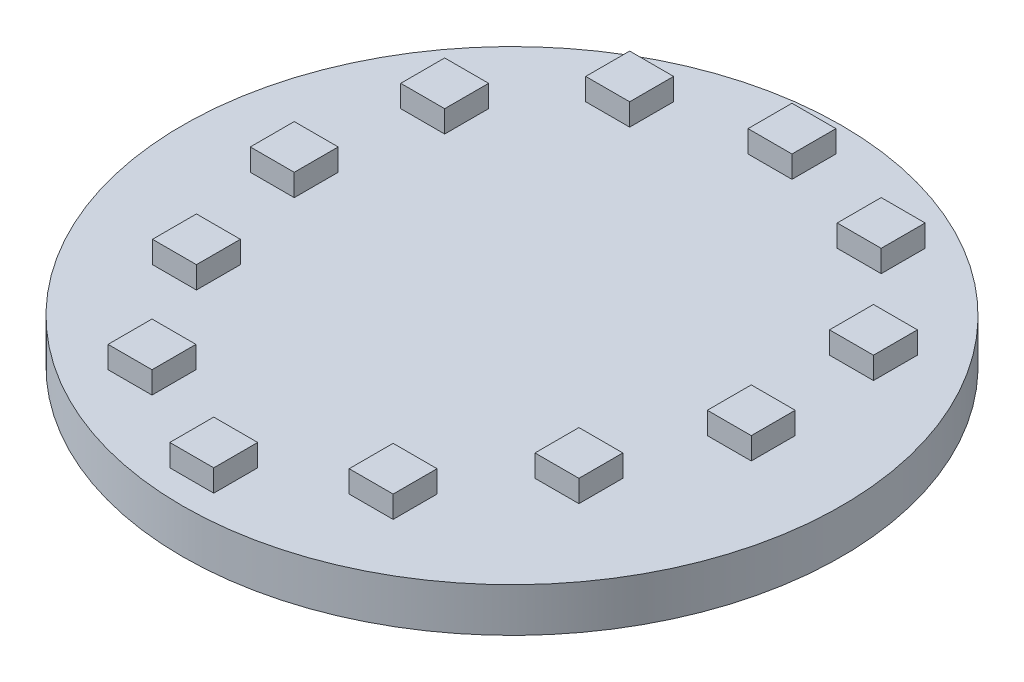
ISO-10303-21;
HEADER;
FILE_DESCRIPTION(('STEP AP214'),'2;1');
FILE_NAME('part.step','',(''),(''),'','','');
FILE_SCHEMA(('AUTOMOTIVE_DESIGN { 1 0 10303 214 1 1 1 1 }'));
ENDSEC;
DATA;
#1=APPLICATION_CONTEXT('core data for automotive mechanical design processes');
#2=APPLICATION_PROTOCOL_DEFINITION('international standard','automotive_design',2000,#1);
#3=PRODUCT_CONTEXT('',#1,'mechanical');
#4=PRODUCT('Part','Part','',(#3));
#5=PRODUCT_RELATED_PRODUCT_CATEGORY('part','',(#4));
#6=PRODUCT_DEFINITION_FORMATION('','',#4);
#7=PRODUCT_DEFINITION_CONTEXT('part definition',#1,'design');
#8=PRODUCT_DEFINITION('design','',#6,#7);
#9=PRODUCT_DEFINITION_SHAPE('','',#8);
#10=(LENGTH_UNIT() NAMED_UNIT(*) SI_UNIT(.MILLI.,.METRE.));
#11=(NAMED_UNIT(*) PLANE_ANGLE_UNIT() SI_UNIT($,.RADIAN.));
#12=(NAMED_UNIT(*) SI_UNIT($,.STERADIAN.) SOLID_ANGLE_UNIT());
#13=UNCERTAINTY_MEASURE_WITH_UNIT(LENGTH_MEASURE(1.E-05),#10,'distance_accuracy_value','');
#14=(GEOMETRIC_REPRESENTATION_CONTEXT(3) GLOBAL_UNCERTAINTY_ASSIGNED_CONTEXT((#13)) GLOBAL_UNIT_ASSIGNED_CONTEXT((#10,
#11,#12)) REPRESENTATION_CONTEXT('',''));
#15=CARTESIAN_POINT('',(0.,0.,0.));
#16=DIRECTION('',(0.,0.,1.));
#17=DIRECTION('',(1.,0.,0.));
#18=AXIS2_PLACEMENT_3D('',#15,#16,#17);
#19=CARTESIAN_POINT('',(0.,10.,0.));
#20=DIRECTION('',(0.,1.,0.));
#21=DIRECTION('',(0.,0.,1.));
#22=AXIS2_PLACEMENT_3D('',#19,#20,#21);
#23=PLANE('',#22);
#24=DIRECTION('',(-1.,0.,0.));
#25=VECTOR('',#24,1.);
#26=CARTESIAN_POINT('',(-53.4485549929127,10.,-38.1275090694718));
#27=LINE('',#26,#25);
#28=CARTESIAN_POINT('',(-43.4485549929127,10.,-38.1275090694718));
#29=VERTEX_POINT('',#28);
#30=CARTESIAN_POINT('',(-53.4485549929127,10.,-38.1275090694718));
#31=VERTEX_POINT('',#30);
#32=EDGE_CURVE('E367',#29,#31,#27,.T.);
#33=ORIENTED_EDGE('',*,*,#32,.F.);
#34=DIRECTION('',(0.,0.,-1.));
#35=VECTOR('',#34,1.);
#36=CARTESIAN_POINT('',(-43.4485549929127,10.,-28.1275090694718));
#37=LINE('',#36,#35);
#38=CARTESIAN_POINT('',(-43.4485549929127,10.,-28.1275090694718));
#39=VERTEX_POINT('',#38);
#40=EDGE_CURVE('E364',#39,#29,#37,.T.);
#41=ORIENTED_EDGE('',*,*,#40,.F.);
#42=DIRECTION('',(1.,0.,0.));
#43=VECTOR('',#42,1.);
#44=CARTESIAN_POINT('',(-53.4485549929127,10.,-28.1275090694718));
#45=LINE('',#44,#43);
#46=CARTESIAN_POINT('',(-53.4485549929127,10.,-28.1275090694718));
#47=VERTEX_POINT('',#46);
#48=EDGE_CURVE('E376',#47,#39,#45,.T.);
#49=ORIENTED_EDGE('',*,*,#48,.F.);
#50=DIRECTION('',(0.,0.,1.));
#51=VECTOR('',#50,1.);
#52=CARTESIAN_POINT('',(-53.4485549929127,10.,-28.1275090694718));
#53=LINE('',#52,#51);
#54=EDGE_CURVE('E384',#31,#47,#53,.T.);
#55=ORIENTED_EDGE('',*,*,#54,.F.);
#56=EDGE_LOOP('',(#33,#41,#49,#55));
#57=FACE_BOUND('',#56,.T.);
#58=DIRECTION('',(-1.,0.,0.));
#59=VECTOR('',#58,1.);
#60=CARTESIAN_POINT('',(-50.9536430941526,10.,20.8599408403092));
#61=LINE('',#60,#59);
#62=CARTESIAN_POINT('',(-40.9536430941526,10.,20.8599408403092));
#63=VERTEX_POINT('',#62);
#64=CARTESIAN_POINT('',(-50.9536430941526,10.,20.8599408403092));
#65=VERTEX_POINT('',#64);
#66=EDGE_CURVE('E438',#63,#65,#61,.T.);
#67=ORIENTED_EDGE('',*,*,#66,.F.);
#68=DIRECTION('',(0.,0.,-1.));
#69=VECTOR('',#68,1.);
#70=CARTESIAN_POINT('',(-40.9536430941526,10.,30.8599408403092));
#71=LINE('',#70,#69);
#72=CARTESIAN_POINT('',(-40.9536430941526,10.,30.8599408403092));
#73=VERTEX_POINT('',#72);
#74=EDGE_CURVE('E424',#73,#63,#71,.T.);
#75=ORIENTED_EDGE('',*,*,#74,.F.);
#76=DIRECTION('',(1.,0.,0.));
#77=VECTOR('',#76,1.);
#78=CARTESIAN_POINT('',(-50.9536430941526,10.,30.8599408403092));
#79=LINE('',#78,#77);
#80=CARTESIAN_POINT('',(-50.9536430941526,10.,30.8599408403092));
#81=VERTEX_POINT('',#80);
#82=EDGE_CURVE('E429',#81,#73,#79,.T.);
#83=ORIENTED_EDGE('',*,*,#82,.F.);
#84=DIRECTION('',(0.,0.,1.));
#85=VECTOR('',#84,1.);
#86=CARTESIAN_POINT('',(-50.9536430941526,10.,30.8599408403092));
#87=LINE('',#86,#85);
#88=EDGE_CURVE('E440',#65,#81,#87,.T.);
#89=ORIENTED_EDGE('',*,*,#88,.F.);
#90=EDGE_LOOP('',(#67,#75,#83,#89));
#91=FACE_BOUND('',#90,.T.);
#92=DIRECTION('',(-1.,0.,0.));
#93=VECTOR('',#92,1.);
#94=CARTESIAN_POINT('',(-8.94423978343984,10.,58.9321380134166));
#95=LINE('',#94,#93);
#96=CARTESIAN_POINT('',(1.05576021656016,10.,58.9321380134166));
#97=VERTEX_POINT('',#96);
#98=CARTESIAN_POINT('',(-8.94423978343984,10.,58.9321380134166));
#99=VERTEX_POINT('',#98);
#100=EDGE_CURVE('E496',#97,#99,#95,.T.);
#101=ORIENTED_EDGE('',*,*,#100,.F.);
#102=DIRECTION('',(0.,0.,-1.));
#103=VECTOR('',#102,1.);
#104=CARTESIAN_POINT('',(1.05576021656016,10.,68.9321380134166));
#105=LINE('',#104,#103);
#106=CARTESIAN_POINT('',(1.05576021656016,10.,68.9321380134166));
#107=VERTEX_POINT('',#106);
#108=EDGE_CURVE('E482',#107,#97,#105,.T.);
#109=ORIENTED_EDGE('',*,*,#108,.F.);
#110=DIRECTION('',(1.,0.,0.));
#111=VECTOR('',#110,1.);
#112=CARTESIAN_POINT('',(-8.94423978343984,10.,68.9321380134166));
#113=LINE('',#112,#111);
#114=CARTESIAN_POINT('',(-8.94423978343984,10.,68.9321380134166));
#115=VERTEX_POINT('',#114);
#116=EDGE_CURVE('E487',#115,#107,#113,.T.);
#117=ORIENTED_EDGE('',*,*,#116,.F.);
#118=DIRECTION('',(0.,0.,1.));
#119=VECTOR('',#118,1.);
#120=CARTESIAN_POINT('',(-8.94423978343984,10.,68.9321380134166));
#121=LINE('',#120,#119);
#122=EDGE_CURVE('E498',#99,#115,#121,.T.);
#123=ORIENTED_EDGE('',*,*,#122,.F.);
#124=EDGE_LOOP('',(#101,#109,#117,#123));
#125=FACE_BOUND('',#124,.T.);
#126=DIRECTION('',(-1.,0.,0.));
#127=VECTOR('',#126,1.);
#128=CARTESIAN_POINT('',(34.6744776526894,10.,19.446739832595));
#129=LINE('',#128,#127);
#130=CARTESIAN_POINT('',(44.6744776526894,10.,19.446739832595));
#131=VERTEX_POINT('',#130);
#132=CARTESIAN_POINT('',(34.6744776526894,10.,19.446739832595));
#133=VERTEX_POINT('',#132);
#134=EDGE_CURVE('E554',#131,#133,#129,.T.);
#135=ORIENTED_EDGE('',*,*,#134,.F.);
#136=DIRECTION('',(0.,0.,-1.));
#137=VECTOR('',#136,1.);
#138=CARTESIAN_POINT('',(44.6744776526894,10.,29.446739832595));
#139=LINE('',#138,#137);
#140=CARTESIAN_POINT('',(44.6744776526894,10.,29.446739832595));
#141=VERTEX_POINT('',#140);
#142=EDGE_CURVE('E540',#141,#131,#139,.T.);
#143=ORIENTED_EDGE('',*,*,#142,.F.);
#144=DIRECTION('',(1.,0.,0.));
#145=VECTOR('',#144,1.);
#146=CARTESIAN_POINT('',(34.6744776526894,10.,29.446739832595));
#147=LINE('',#146,#145);
#148=CARTESIAN_POINT('',(34.6744776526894,10.,29.446739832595));
#149=VERTEX_POINT('',#148);
#150=EDGE_CURVE('E545',#149,#141,#147,.T.);
#151=ORIENTED_EDGE('',*,*,#150,.F.);
#152=DIRECTION('',(0.,0.,1.));
#153=VECTOR('',#152,1.);
#154=CARTESIAN_POINT('',(34.6744776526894,10.,29.446739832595));
#155=LINE('',#154,#153);
#156=EDGE_CURVE('E556',#133,#149,#155,.T.);
#157=ORIENTED_EDGE('',*,*,#156,.F.);
#158=EDGE_LOOP('',(#135,#143,#151,#157));
#159=FACE_BOUND('',#158,.T.);
#160=DIRECTION('',(-1.,0.,0.));
#161=VECTOR('',#160,1.);
#162=CARTESIAN_POINT('',(43.9261537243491,10.,-38.3350058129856));
#163=LINE('',#162,#161);
#164=CARTESIAN_POINT('',(53.9261537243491,10.,-38.3350058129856));
#165=VERTEX_POINT('',#164);
#166=CARTESIAN_POINT('',(43.9261537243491,10.,-38.3350058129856));
#167=VERTEX_POINT('',#166);
#168=EDGE_CURVE('E612',#165,#167,#163,.T.);
#169=ORIENTED_EDGE('',*,*,#168,.F.);
#170=DIRECTION('',(0.,0.,-1.));
#171=VECTOR('',#170,1.);
#172=CARTESIAN_POINT('',(53.9261537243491,10.,-28.3350058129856));
#173=LINE('',#172,#171);
#174=CARTESIAN_POINT('',(53.9261537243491,10.,-28.3350058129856));
#175=VERTEX_POINT('',#174);
#176=EDGE_CURVE('E598',#175,#165,#173,.T.);
#177=ORIENTED_EDGE('',*,*,#176,.F.);
#178=DIRECTION('',(1.,0.,0.));
#179=VECTOR('',#178,1.);
#180=CARTESIAN_POINT('',(43.9261537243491,10.,-28.3350058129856));
#181=LINE('',#180,#179);
#182=CARTESIAN_POINT('',(43.9261537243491,10.,-28.3350058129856));
#183=VERTEX_POINT('',#182);
#184=EDGE_CURVE('E603',#183,#175,#181,.T.);
#185=ORIENTED_EDGE('',*,*,#184,.F.);
#186=DIRECTION('',(0.,0.,1.));
#187=VECTOR('',#186,1.);
#188=CARTESIAN_POINT('',(43.9261537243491,10.,-28.3350058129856));
#189=LINE('',#188,#187);
#190=EDGE_CURVE('E614',#167,#183,#189,.T.);
#191=ORIENTED_EDGE('',*,*,#190,.F.);
#192=EDGE_LOOP('',(#169,#177,#185,#191));
#193=FACE_BOUND('',#192,.T.);
#194=DIRECTION('',(-1.,0.,0.));
#195=VECTOR('',#194,1.);
#196=CARTESIAN_POINT('',(-4.99999999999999,10.,-68.7158375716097));
#197=LINE('',#196,#195);
#198=CARTESIAN_POINT('',(5.00000000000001,10.,-68.7158375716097));
#199=VERTEX_POINT('',#198);
#200=CARTESIAN_POINT('',(-4.99999999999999,10.,-68.7158375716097));
#201=VERTEX_POINT('',#200);
#202=EDGE_CURVE('E670',#199,#201,#197,.T.);
#203=ORIENTED_EDGE('',*,*,#202,.F.);
#204=DIRECTION('',(0.,0.,-1.));
#205=VECTOR('',#204,1.);
#206=CARTESIAN_POINT('',(5.00000000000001,10.,-58.7158375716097));
#207=LINE('',#206,#205);
#208=CARTESIAN_POINT('',(5.00000000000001,10.,-58.7158375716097));
#209=VERTEX_POINT('',#208);
#210=EDGE_CURVE('E656',#209,#199,#207,.T.);
#211=ORIENTED_EDGE('',*,*,#210,.F.);
#212=DIRECTION('',(1.,0.,0.));
#213=VECTOR('',#212,1.);
#214=CARTESIAN_POINT('',(-4.99999999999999,10.,-58.7158375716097));
#215=LINE('',#214,#213);
#216=CARTESIAN_POINT('',(-4.99999999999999,10.,-58.7158375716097));
#217=VERTEX_POINT('',#216);
#218=EDGE_CURVE('E661',#217,#209,#215,.T.);
#219=ORIENTED_EDGE('',*,*,#218,.F.);
#220=DIRECTION('',(0.,0.,1.));
#221=VECTOR('',#220,1.);
#222=CARTESIAN_POINT('',(-4.99999999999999,10.,-58.7158375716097));
#223=LINE('',#222,#221);
#224=EDGE_CURVE('E672',#201,#217,#223,.T.);
#225=ORIENTED_EDGE('',*,*,#224,.F.);
#226=EDGE_LOOP('',(#203,#211,#219,#225));
#227=FACE_BOUND('',#226,.T.);
#228=CARTESIAN_POINT('',(0.,10.,0.));
#229=DIRECTION('',(0.,1.,0.));
#230=DIRECTION('',(0.,0.,1.));
#231=AXIS2_PLACEMENT_3D('',#228,#229,#230);
#232=CIRCLE('',#231,75.);
#233=CARTESIAN_POINT('',(0.,10.,75.));
#234=VERTEX_POINT('',#233);
#235=EDGE_CURVE('E11',#234,#234,#232,.T.);
#236=ORIENTED_EDGE('',*,*,#235,.T.);
#237=EDGE_LOOP('',(#236));
#238=FACE_BOUND('',#237,.T.);
#239=DIRECTION('',(-1.,0.,0.));
#240=VECTOR('',#239,1.);
#241=CARTESIAN_POINT('',(23.7406187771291,10.,-60.2771757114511));
#242=LINE('',#241,#240);
#243=CARTESIAN_POINT('',(33.7406187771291,10.,-60.2771757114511));
#244=VERTEX_POINT('',#243);
#245=CARTESIAN_POINT('',(23.7406187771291,10.,-60.2771757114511));
#246=VERTEX_POINT('',#245);
#247=EDGE_CURVE('E641',#244,#246,#242,.T.);
#248=ORIENTED_EDGE('',*,*,#247,.F.);
#249=DIRECTION('',(0.,0.,-1.));
#250=VECTOR('',#249,1.);
#251=CARTESIAN_POINT('',(33.7406187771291,10.,-50.2771757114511));
#252=LINE('',#251,#250);
#253=CARTESIAN_POINT('',(33.7406187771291,10.,-50.2771757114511));
#254=VERTEX_POINT('',#253);
#255=EDGE_CURVE('E627',#254,#244,#252,.T.);
#256=ORIENTED_EDGE('',*,*,#255,.F.);
#257=DIRECTION('',(1.,0.,0.));
#258=VECTOR('',#257,1.);
#259=CARTESIAN_POINT('',(23.7406187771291,10.,-50.2771757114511));
#260=LINE('',#259,#258);
#261=CARTESIAN_POINT('',(23.7406187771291,10.,-50.2771757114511));
#262=VERTEX_POINT('',#261);
#263=EDGE_CURVE('E632',#262,#254,#260,.T.);
#264=ORIENTED_EDGE('',*,*,#263,.F.);
#265=DIRECTION('',(0.,0.,1.));
#266=VECTOR('',#265,1.);
#267=CARTESIAN_POINT('',(23.7406187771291,10.,-50.2771757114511));
#268=LINE('',#267,#266);
#269=EDGE_CURVE('E643',#246,#262,#268,.T.);
#270=ORIENTED_EDGE('',*,*,#269,.F.);
#271=EDGE_LOOP('',(#248,#256,#264,#270));
#272=FACE_BOUND('',#271,.T.);
#273=DIRECTION('',(-1.,0.,0.));
#274=VECTOR('',#273,1.);
#275=CARTESIAN_POINT('',(45.8745379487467,10.,-8.57730436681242));
#276=LINE('',#275,#274);
#277=CARTESIAN_POINT('',(55.8745379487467,10.,-8.57730436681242));
#278=VERTEX_POINT('',#277);
#279=CARTESIAN_POINT('',(45.8745379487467,10.,-8.57730436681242));
#280=VERTEX_POINT('',#279);
#281=EDGE_CURVE('E583',#278,#280,#276,.T.);
#282=ORIENTED_EDGE('',*,*,#281,.F.);
#283=DIRECTION('',(0.,0.,-1.));
#284=VECTOR('',#283,1.);
#285=CARTESIAN_POINT('',(55.8745379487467,10.,1.42269563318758));
#286=LINE('',#285,#284);
#287=CARTESIAN_POINT('',(55.8745379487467,10.,1.42269563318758));
#288=VERTEX_POINT('',#287);
#289=EDGE_CURVE('E569',#288,#278,#286,.T.);
#290=ORIENTED_EDGE('',*,*,#289,.F.);
#291=DIRECTION('',(1.,0.,0.));
#292=VECTOR('',#291,1.);
#293=CARTESIAN_POINT('',(45.8745379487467,10.,1.42269563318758));
#294=LINE('',#293,#292);
#295=CARTESIAN_POINT('',(45.8745379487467,10.,1.42269563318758));
#296=VERTEX_POINT('',#295);
#297=EDGE_CURVE('E574',#296,#288,#294,.T.);
#298=ORIENTED_EDGE('',*,*,#297,.F.);
#299=DIRECTION('',(0.,0.,1.));
#300=VECTOR('',#299,1.);
#301=CARTESIAN_POINT('',(45.8745379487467,10.,1.42269563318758));
#302=LINE('',#301,#300);
#303=EDGE_CURVE('E585',#280,#296,#302,.T.);
#304=ORIENTED_EDGE('',*,*,#303,.F.);
#305=EDGE_LOOP('',(#282,#290,#298,#304));
#306=FACE_BOUND('',#305,.T.);
#307=DIRECTION('',(-1.,0.,0.));
#308=VECTOR('',#307,1.);
#309=CARTESIAN_POINT('',(16.638587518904,10.,43.6931317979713));
#310=LINE('',#309,#308);
#311=CARTESIAN_POINT('',(26.638587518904,10.,43.6931317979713));
#312=VERTEX_POINT('',#311);
#313=CARTESIAN_POINT('',(16.638587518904,10.,43.6931317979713));
#314=VERTEX_POINT('',#313);
#315=EDGE_CURVE('E525',#312,#314,#310,.T.);
#316=ORIENTED_EDGE('',*,*,#315,.F.);
#317=DIRECTION('',(0.,0.,-1.));
#318=VECTOR('',#317,1.);
#319=CARTESIAN_POINT('',(26.638587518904,10.,53.6931317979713));
#320=LINE('',#319,#318);
#321=CARTESIAN_POINT('',(26.638587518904,10.,53.6931317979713));
#322=VERTEX_POINT('',#321);
#323=EDGE_CURVE('E511',#322,#312,#320,.T.);
#324=ORIENTED_EDGE('',*,*,#323,.F.);
#325=DIRECTION('',(1.,0.,0.));
#326=VECTOR('',#325,1.);
#327=CARTESIAN_POINT('',(16.638587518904,10.,53.6931317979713));
#328=LINE('',#327,#326);
#329=CARTESIAN_POINT('',(16.638587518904,10.,53.6931317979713));
#330=VERTEX_POINT('',#329);
#331=EDGE_CURVE('E516',#330,#322,#328,.T.);
#332=ORIENTED_EDGE('',*,*,#331,.F.);
#333=DIRECTION('',(0.,0.,1.));
#334=VECTOR('',#333,1.);
#335=CARTESIAN_POINT('',(16.638587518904,10.,53.6931317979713));
#336=LINE('',#335,#334);
#337=EDGE_CURVE('E527',#314,#330,#336,.T.);
#338=ORIENTED_EDGE('',*,*,#337,.F.);
#339=EDGE_LOOP('',(#316,#324,#332,#338));
#340=FACE_BOUND('',#339,.T.);
#341=DIRECTION('',(-1.,0.,0.));
#342=VECTOR('',#341,1.);
#343=CARTESIAN_POINT('',(-35.3008820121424,10.,46.628046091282));
#344=LINE('',#343,#342);
#345=CARTESIAN_POINT('',(-25.3008820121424,10.,46.628046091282));
#346=VERTEX_POINT('',#345);
#347=CARTESIAN_POINT('',(-35.3008820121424,10.,46.628046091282));
#348=VERTEX_POINT('',#347);
#349=EDGE_CURVE('E467',#346,#348,#344,.T.);
#350=ORIENTED_EDGE('',*,*,#349,.F.);
#351=DIRECTION('',(0.,0.,-1.));
#352=VECTOR('',#351,1.);
#353=CARTESIAN_POINT('',(-25.3008820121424,10.,56.628046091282));
#354=LINE('',#353,#352);
#355=CARTESIAN_POINT('',(-25.3008820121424,10.,56.628046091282));
#356=VERTEX_POINT('',#355);
#357=EDGE_CURVE('E453',#356,#346,#354,.T.);
#358=ORIENTED_EDGE('',*,*,#357,.F.);
#359=DIRECTION('',(1.,0.,0.));
#360=VECTOR('',#359,1.);
#361=CARTESIAN_POINT('',(-35.3008820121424,10.,56.628046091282));
#362=LINE('',#361,#360);
#363=CARTESIAN_POINT('',(-35.3008820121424,10.,56.628046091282));
#364=VERTEX_POINT('',#363);
#365=EDGE_CURVE('E458',#364,#356,#362,.T.);
#366=ORIENTED_EDGE('',*,*,#365,.F.);
#367=DIRECTION('',(0.,0.,1.));
#368=VECTOR('',#367,1.);
#369=CARTESIAN_POINT('',(-35.3008820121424,10.,56.628046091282));
#370=LINE('',#369,#368);
#371=EDGE_CURVE('E469',#348,#364,#370,.T.);
#372=ORIENTED_EDGE('',*,*,#371,.F.);
#373=EDGE_LOOP('',(#350,#358,#366,#372));
#374=FACE_BOUND('',#373,.T.);
#375=DIRECTION('',(-1.,0.,0.));
#376=VECTOR('',#375,1.);
#377=CARTESIAN_POINT('',(-58.0280893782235,10.,-8.47256918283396));
#378=LINE('',#377,#376);
#379=CARTESIAN_POINT('',(-48.0280893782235,10.,-8.47256918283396));
#380=VERTEX_POINT('',#379);
#381=CARTESIAN_POINT('',(-58.0280893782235,10.,-8.47256918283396));
#382=VERTEX_POINT('',#381);
#383=EDGE_CURVE('E409',#380,#382,#378,.T.);
#384=ORIENTED_EDGE('',*,*,#383,.F.);
#385=DIRECTION('',(0.,0.,-1.));
#386=VECTOR('',#385,1.);
#387=CARTESIAN_POINT('',(-48.0280893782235,10.,1.52743081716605));
#388=LINE('',#387,#386);
#389=CARTESIAN_POINT('',(-48.0280893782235,10.,1.52743081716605));
#390=VERTEX_POINT('',#389);
#391=EDGE_CURVE('E395',#390,#380,#388,.T.);
#392=ORIENTED_EDGE('',*,*,#391,.F.);
#393=DIRECTION('',(1.,0.,0.));
#394=VECTOR('',#393,1.);
#395=CARTESIAN_POINT('',(-58.0280893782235,10.,1.52743081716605));
#396=LINE('',#395,#394);
#397=CARTESIAN_POINT('',(-58.0280893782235,10.,1.52743081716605));
#398=VERTEX_POINT('',#397);
#399=EDGE_CURVE('E400',#398,#390,#396,.T.);
#400=ORIENTED_EDGE('',*,*,#399,.F.);
#401=DIRECTION('',(0.,0.,1.));
#402=VECTOR('',#401,1.);
#403=CARTESIAN_POINT('',(-58.0280893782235,10.,1.52743081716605));
#404=LINE('',#403,#402);
#405=EDGE_CURVE('E411',#382,#398,#404,.T.);
#406=ORIENTED_EDGE('',*,*,#405,.F.);
#407=EDGE_LOOP('',(#384,#392,#400,#406));
#408=FACE_BOUND('',#407,.T.);
#409=DIRECTION('',(-1.,0.,0.));
#410=VECTOR('',#409,1.);
#411=CARTESIAN_POINT('',(-33.761379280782,10.,-60.536856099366));
#412=LINE('',#411,#410);
#413=CARTESIAN_POINT('',(-23.761379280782,10.,-60.536856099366));
#414=VERTEX_POINT('',#413);
#415=CARTESIAN_POINT('',(-33.761379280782,10.,-60.536856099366));
#416=VERTEX_POINT('',#415);
#417=EDGE_CURVE('E1315',#414,#416,#412,.T.);
#418=ORIENTED_EDGE('',*,*,#417,.F.);
#419=DIRECTION('',(0.,0.,-1.));
#420=VECTOR('',#419,1.);
#421=CARTESIAN_POINT('',(-23.761379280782,10.,-50.536856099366));
#422=LINE('',#421,#420);
#423=CARTESIAN_POINT('',(-23.761379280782,10.,-50.536856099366));
#424=VERTEX_POINT('',#423);
#425=EDGE_CURVE('E362',#424,#414,#422,.T.);
#426=ORIENTED_EDGE('',*,*,#425,.F.);
#427=DIRECTION('',(1.,0.,0.));
#428=VECTOR('',#427,1.);
#429=CARTESIAN_POINT('',(-33.761379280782,10.,-50.536856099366));
#430=LINE('',#429,#428);
#431=CARTESIAN_POINT('',(-33.761379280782,10.,-50.536856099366));
#432=VERTEX_POINT('',#431);
#433=EDGE_CURVE('E358',#432,#424,#430,.T.);
#434=ORIENTED_EDGE('',*,*,#433,.F.);
#435=DIRECTION('',(0.,0.,1.));
#436=VECTOR('',#435,1.);
#437=CARTESIAN_POINT('',(-33.761379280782,10.,-50.536856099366));
#438=LINE('',#437,#436);
#439=EDGE_CURVE('E1312',#416,#432,#438,.T.);
#440=ORIENTED_EDGE('',*,*,#439,.F.);
#441=EDGE_LOOP('',(#418,#426,#434,#440));
#442=FACE_BOUND('',#441,.T.);
#443=ADVANCED_FACE('F33',(#57,#91,#125,#159,#193,#227,#238,#272,#306,#340,#374,#408,#442),#23,.T.);
#444=CARTESIAN_POINT('',(0.,10.,0.));
#445=DIRECTION('',(0.,-1.,0.));
#446=DIRECTION('',(0.,0.,-1.));
#447=AXIS2_PLACEMENT_3D('',#444,#445,#446);
#448=CYLINDRICAL_SURFACE('',#447,75.);
#449=ORIENTED_EDGE('',*,*,#235,.F.);
#450=EDGE_LOOP('',(#449));
#451=FACE_BOUND('',#450,.T.);
#452=CARTESIAN_POINT('',(0.,0.,0.));
#453=DIRECTION('',(0.,1.,0.));
#454=DIRECTION('',(0.,0.,1.));
#455=AXIS2_PLACEMENT_3D('',#452,#453,#454);
#456=CIRCLE('',#455,75.);
#457=CARTESIAN_POINT('',(0.,0.,75.));
#458=VERTEX_POINT('',#457);
#459=EDGE_CURVE('E37',#458,#458,#456,.T.);
#460=ORIENTED_EDGE('',*,*,#459,.T.);
#461=EDGE_LOOP('',(#460));
#462=FACE_BOUND('',#461,.T.);
#463=ADVANCED_FACE('F35',(#451,#462),#448,.T.);
#464=CARTESIAN_POINT('',(0.,0.,0.));
#465=DIRECTION('',(0.,1.,0.));
#466=DIRECTION('',(0.,0.,1.));
#467=AXIS2_PLACEMENT_3D('',#464,#465,#466);
#468=PLANE('',#467);
#469=ORIENTED_EDGE('',*,*,#459,.F.);
#470=EDGE_LOOP('',(#469));
#471=FACE_BOUND('',#470,.T.);
#472=ADVANCED_FACE('F690',(#471),#468,.F.);
#473=CARTESIAN_POINT('',(5.00000000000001,15.,-58.7158375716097));
#474=DIRECTION('',(-1.,0.,0.));
#475=DIRECTION('',(0.,0.,1.));
#476=AXIS2_PLACEMENT_3D('',#473,#474,#475);
#477=PLANE('',#476);
#478=ORIENTED_EDGE('',*,*,#210,.T.);
#479=DIRECTION('',(0.,-1.,0.));
#480=VECTOR('',#479,1.);
#481=CARTESIAN_POINT('',(5.00000000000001,15.,-68.7158375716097));
#482=LINE('',#481,#480);
#483=CARTESIAN_POINT('',(5.00000000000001,15.,-68.7158375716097));
#484=VERTEX_POINT('',#483);
#485=EDGE_CURVE('E683',#484,#199,#482,.T.);
#486=ORIENTED_EDGE('',*,*,#485,.F.);
#487=DIRECTION('',(0.,0.,-1.));
#488=VECTOR('',#487,1.);
#489=CARTESIAN_POINT('',(5.00000000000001,15.,-58.7158375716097));
#490=LINE('',#489,#488);
#491=CARTESIAN_POINT('',(5.00000000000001,15.,-58.7158375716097));
#492=VERTEX_POINT('',#491);
#493=EDGE_CURVE('E657',#492,#484,#490,.T.);
#494=ORIENTED_EDGE('',*,*,#493,.F.);
#495=DIRECTION('',(0.,-1.,0.));
#496=VECTOR('',#495,1.);
#497=CARTESIAN_POINT('',(5.00000000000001,15.,-58.7158375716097));
#498=LINE('',#497,#496);
#499=EDGE_CURVE('E667',#492,#209,#498,.T.);
#500=ORIENTED_EDGE('',*,*,#499,.T.);
#501=EDGE_LOOP('',(#478,#486,#494,#500));
#502=FACE_BOUND('',#501,.T.);
#503=ADVANCED_FACE('F692',(#502),#477,.F.);
#504=CARTESIAN_POINT('',(-4.99999999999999,15.,-68.7158375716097));
#505=DIRECTION('',(0.,0.,1.));
#506=DIRECTION('',(1.,0.,0.));
#507=AXIS2_PLACEMENT_3D('',#504,#505,#506);
#508=PLANE('',#507);
#509=ORIENTED_EDGE('',*,*,#202,.T.);
#510=DIRECTION('',(0.,-1.,0.));
#511=VECTOR('',#510,1.);
#512=CARTESIAN_POINT('',(-4.99999999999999,15.,-68.7158375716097));
#513=LINE('',#512,#511);
#514=CARTESIAN_POINT('',(-4.99999999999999,15.,-68.7158375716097));
#515=VERTEX_POINT('',#514);
#516=EDGE_CURVE('E680',#515,#201,#513,.T.);
#517=ORIENTED_EDGE('',*,*,#516,.F.);
#518=DIRECTION('',(-1.,0.,0.));
#519=VECTOR('',#518,1.);
#520=CARTESIAN_POINT('',(-4.99999999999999,15.,-68.7158375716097));
#521=LINE('',#520,#519);
#522=EDGE_CURVE('E660',#484,#515,#521,.T.);
#523=ORIENTED_EDGE('',*,*,#522,.F.);
#524=ORIENTED_EDGE('',*,*,#485,.T.);
#525=EDGE_LOOP('',(#509,#517,#523,#524));
#526=FACE_BOUND('',#525,.T.);
#527=ADVANCED_FACE('F697',(#526),#508,.F.);
#528=CARTESIAN_POINT('',(-4.99999999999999,15.,-58.7158375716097));
#529=DIRECTION('',(1.,0.,0.));
#530=DIRECTION('',(0.,0.,-1.));
#531=AXIS2_PLACEMENT_3D('',#528,#529,#530);
#532=PLANE('',#531);
#533=ORIENTED_EDGE('',*,*,#224,.T.);
#534=DIRECTION('',(0.,-1.,0.));
#535=VECTOR('',#534,1.);
#536=CARTESIAN_POINT('',(-4.99999999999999,15.,-58.7158375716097));
#537=LINE('',#536,#535);
#538=CARTESIAN_POINT('',(-4.99999999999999,15.,-58.7158375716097));
#539=VERTEX_POINT('',#538);
#540=EDGE_CURVE('E678',#539,#217,#537,.T.);
#541=ORIENTED_EDGE('',*,*,#540,.F.);
#542=DIRECTION('',(0.,0.,1.));
#543=VECTOR('',#542,1.);
#544=CARTESIAN_POINT('',(-4.99999999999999,15.,-58.7158375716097));
#545=LINE('',#544,#543);
#546=EDGE_CURVE('E663',#515,#539,#545,.T.);
#547=ORIENTED_EDGE('',*,*,#546,.F.);
#548=ORIENTED_EDGE('',*,*,#516,.T.);
#549=EDGE_LOOP('',(#533,#541,#547,#548));
#550=FACE_BOUND('',#549,.T.);
#551=ADVANCED_FACE('F711',(#550),#532,.F.);
#552=CARTESIAN_POINT('',(-4.99999999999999,15.,-58.7158375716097));
#553=DIRECTION('',(0.,0.,-1.));
#554=DIRECTION('',(-1.,0.,0.));
#555=AXIS2_PLACEMENT_3D('',#552,#553,#554);
#556=PLANE('',#555);
#557=ORIENTED_EDGE('',*,*,#218,.T.);
#558=ORIENTED_EDGE('',*,*,#499,.F.);
#559=DIRECTION('',(1.,0.,0.));
#560=VECTOR('',#559,1.);
#561=CARTESIAN_POINT('',(-4.99999999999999,15.,-58.7158375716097));
#562=LINE('',#561,#560);
#563=EDGE_CURVE('E665',#539,#492,#562,.T.);
#564=ORIENTED_EDGE('',*,*,#563,.F.);
#565=ORIENTED_EDGE('',*,*,#540,.T.);
#566=EDGE_LOOP('',(#557,#558,#564,#565));
#567=FACE_BOUND('',#566,.T.);
#568=ADVANCED_FACE('F714',(#567),#556,.F.);
#569=CARTESIAN_POINT('',(5.00000000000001,15.,-68.7158375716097));
#570=DIRECTION('',(0.,-1.,0.));
#571=DIRECTION('',(0.,0.,-1.));
#572=AXIS2_PLACEMENT_3D('',#569,#570,#571);
#573=PLANE('',#572);
#574=ORIENTED_EDGE('',*,*,#493,.T.);
#575=ORIENTED_EDGE('',*,*,#522,.T.);
#576=ORIENTED_EDGE('',*,*,#546,.T.);
#577=ORIENTED_EDGE('',*,*,#563,.T.);
#578=EDGE_LOOP('',(#574,#575,#576,#577));
#579=FACE_BOUND('',#578,.T.);
#580=ADVANCED_FACE('F718',(#579),#573,.F.);
#581=CARTESIAN_POINT('',(33.7406187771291,15.,-50.2771757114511));
#582=DIRECTION('',(-1.,0.,0.));
#583=DIRECTION('',(0.,0.,1.));
#584=AXIS2_PLACEMENT_3D('',#581,#582,#583);
#585=PLANE('',#584);
#586=ORIENTED_EDGE('',*,*,#255,.T.);
#587=DIRECTION('',(0.,-1.,0.));
#588=VECTOR('',#587,1.);
#589=CARTESIAN_POINT('',(33.7406187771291,15.,-60.2771757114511));
#590=LINE('',#589,#588);
#591=CARTESIAN_POINT('',(33.7406187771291,15.,-60.2771757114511));
#592=VERTEX_POINT('',#591);
#593=EDGE_CURVE('E654',#592,#244,#590,.T.);
#594=ORIENTED_EDGE('',*,*,#593,.F.);
#595=DIRECTION('',(0.,0.,-1.));
#596=VECTOR('',#595,1.);
#597=CARTESIAN_POINT('',(33.7406187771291,15.,-50.2771757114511));
#598=LINE('',#597,#596);
#599=CARTESIAN_POINT('',(33.7406187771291,15.,-50.2771757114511));
#600=VERTEX_POINT('',#599);
#601=EDGE_CURVE('E628',#600,#592,#598,.T.);
#602=ORIENTED_EDGE('',*,*,#601,.F.);
#603=DIRECTION('',(0.,-1.,0.));
#604=VECTOR('',#603,1.);
#605=CARTESIAN_POINT('',(33.7406187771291,15.,-50.2771757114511));
#606=LINE('',#605,#604);
#607=EDGE_CURVE('E638',#600,#254,#606,.T.);
#608=ORIENTED_EDGE('',*,*,#607,.T.);
#609=EDGE_LOOP('',(#586,#594,#602,#608));
#610=FACE_BOUND('',#609,.T.);
#611=ADVANCED_FACE('F722',(#610),#585,.F.);
#612=CARTESIAN_POINT('',(23.7406187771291,15.,-60.2771757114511));
#613=DIRECTION('',(0.,0.,1.));
#614=DIRECTION('',(1.,0.,0.));
#615=AXIS2_PLACEMENT_3D('',#612,#613,#614);
#616=PLANE('',#615);
#617=ORIENTED_EDGE('',*,*,#247,.T.);
#618=DIRECTION('',(0.,-1.,0.));
#619=VECTOR('',#618,1.);
#620=CARTESIAN_POINT('',(23.7406187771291,15.,-60.2771757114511));
#621=LINE('',#620,#619);
#622=CARTESIAN_POINT('',(23.7406187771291,15.,-60.2771757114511));
#623=VERTEX_POINT('',#622);
#624=EDGE_CURVE('E651',#623,#246,#621,.T.);
#625=ORIENTED_EDGE('',*,*,#624,.F.);
#626=DIRECTION('',(-1.,0.,0.));
#627=VECTOR('',#626,1.);
#628=CARTESIAN_POINT('',(23.7406187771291,15.,-60.2771757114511));
#629=LINE('',#628,#627);
#630=EDGE_CURVE('E631',#592,#623,#629,.T.);
#631=ORIENTED_EDGE('',*,*,#630,.F.);
#632=ORIENTED_EDGE('',*,*,#593,.T.);
#633=EDGE_LOOP('',(#617,#625,#631,#632));
#634=FACE_BOUND('',#633,.T.);
#635=ADVANCED_FACE('F726',(#634),#616,.F.);
#636=CARTESIAN_POINT('',(23.7406187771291,15.,-50.2771757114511));
#637=DIRECTION('',(1.,0.,0.));
#638=DIRECTION('',(0.,0.,-1.));
#639=AXIS2_PLACEMENT_3D('',#636,#637,#638);
#640=PLANE('',#639);
#641=ORIENTED_EDGE('',*,*,#269,.T.);
#642=DIRECTION('',(0.,-1.,0.));
#643=VECTOR('',#642,1.);
#644=CARTESIAN_POINT('',(23.7406187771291,15.,-50.2771757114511));
#645=LINE('',#644,#643);
#646=CARTESIAN_POINT('',(23.7406187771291,15.,-50.2771757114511));
#647=VERTEX_POINT('',#646);
#648=EDGE_CURVE('E649',#647,#262,#645,.T.);
#649=ORIENTED_EDGE('',*,*,#648,.F.);
#650=DIRECTION('',(0.,0.,1.));
#651=VECTOR('',#650,1.);
#652=CARTESIAN_POINT('',(23.7406187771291,15.,-50.2771757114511));
#653=LINE('',#652,#651);
#654=EDGE_CURVE('E634',#623,#647,#653,.T.);
#655=ORIENTED_EDGE('',*,*,#654,.F.);
#656=ORIENTED_EDGE('',*,*,#624,.T.);
#657=EDGE_LOOP('',(#641,#649,#655,#656));
#658=FACE_BOUND('',#657,.T.);
#659=ADVANCED_FACE('F730',(#658),#640,.F.);
#660=CARTESIAN_POINT('',(23.7406187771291,15.,-50.2771757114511));
#661=DIRECTION('',(0.,0.,-1.));
#662=DIRECTION('',(-1.,0.,0.));
#663=AXIS2_PLACEMENT_3D('',#660,#661,#662);
#664=PLANE('',#663);
#665=ORIENTED_EDGE('',*,*,#263,.T.);
#666=ORIENTED_EDGE('',*,*,#607,.F.);
#667=DIRECTION('',(1.,0.,0.));
#668=VECTOR('',#667,1.);
#669=CARTESIAN_POINT('',(23.7406187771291,15.,-50.2771757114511));
#670=LINE('',#669,#668);
#671=EDGE_CURVE('E636',#647,#600,#670,.T.);
#672=ORIENTED_EDGE('',*,*,#671,.F.);
#673=ORIENTED_EDGE('',*,*,#648,.T.);
#674=EDGE_LOOP('',(#665,#666,#672,#673));
#675=FACE_BOUND('',#674,.T.);
#676=ADVANCED_FACE('F734',(#675),#664,.F.);
#677=CARTESIAN_POINT('',(33.7406187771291,15.,-60.2771757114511));
#678=DIRECTION('',(0.,-1.,0.));
#679=DIRECTION('',(0.,0.,-1.));
#680=AXIS2_PLACEMENT_3D('',#677,#678,#679);
#681=PLANE('',#680);
#682=ORIENTED_EDGE('',*,*,#601,.T.);
#683=ORIENTED_EDGE('',*,*,#630,.T.);
#684=ORIENTED_EDGE('',*,*,#654,.T.);
#685=ORIENTED_EDGE('',*,*,#671,.T.);
#686=EDGE_LOOP('',(#682,#683,#684,#685));
#687=FACE_BOUND('',#686,.T.);
#688=ADVANCED_FACE('F738',(#687),#681,.F.);
#689=CARTESIAN_POINT('',(53.9261537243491,15.,-28.3350058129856));
#690=DIRECTION('',(-1.,0.,0.));
#691=DIRECTION('',(0.,0.,1.));
#692=AXIS2_PLACEMENT_3D('',#689,#690,#691);
#693=PLANE('',#692);
#694=ORIENTED_EDGE('',*,*,#176,.T.);
#695=DIRECTION('',(0.,-1.,0.));
#696=VECTOR('',#695,1.);
#697=CARTESIAN_POINT('',(53.9261537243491,15.,-38.3350058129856));
#698=LINE('',#697,#696);
#699=CARTESIAN_POINT('',(53.9261537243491,15.,-38.3350058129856));
#700=VERTEX_POINT('',#699);
#701=EDGE_CURVE('E625',#700,#165,#698,.T.);
#702=ORIENTED_EDGE('',*,*,#701,.F.);
#703=DIRECTION('',(0.,0.,-1.));
#704=VECTOR('',#703,1.);
#705=CARTESIAN_POINT('',(53.9261537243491,15.,-28.3350058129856));
#706=LINE('',#705,#704);
#707=CARTESIAN_POINT('',(53.9261537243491,15.,-28.3350058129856));
#708=VERTEX_POINT('',#707);
#709=EDGE_CURVE('E599',#708,#700,#706,.T.);
#710=ORIENTED_EDGE('',*,*,#709,.F.);
#711=DIRECTION('',(0.,-1.,0.));
#712=VECTOR('',#711,1.);
#713=CARTESIAN_POINT('',(53.9261537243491,15.,-28.3350058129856));
#714=LINE('',#713,#712);
#715=EDGE_CURVE('E609',#708,#175,#714,.T.);
#716=ORIENTED_EDGE('',*,*,#715,.T.);
#717=EDGE_LOOP('',(#694,#702,#710,#716));
#718=FACE_BOUND('',#717,.T.);
#719=ADVANCED_FACE('F742',(#718),#693,.F.);
#720=CARTESIAN_POINT('',(43.9261537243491,15.,-38.3350058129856));
#721=DIRECTION('',(0.,0.,1.));
#722=DIRECTION('',(1.,0.,0.));
#723=AXIS2_PLACEMENT_3D('',#720,#721,#722);
#724=PLANE('',#723);
#725=ORIENTED_EDGE('',*,*,#168,.T.);
#726=DIRECTION('',(0.,-1.,0.));
#727=VECTOR('',#726,1.);
#728=CARTESIAN_POINT('',(43.9261537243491,15.,-38.3350058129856));
#729=LINE('',#728,#727);
#730=CARTESIAN_POINT('',(43.9261537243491,15.,-38.3350058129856));
#731=VERTEX_POINT('',#730);
#732=EDGE_CURVE('E622',#731,#167,#729,.T.);
#733=ORIENTED_EDGE('',*,*,#732,.F.);
#734=DIRECTION('',(-1.,0.,0.));
#735=VECTOR('',#734,1.);
#736=CARTESIAN_POINT('',(43.9261537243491,15.,-38.3350058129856));
#737=LINE('',#736,#735);
#738=EDGE_CURVE('E602',#700,#731,#737,.T.);
#739=ORIENTED_EDGE('',*,*,#738,.F.);
#740=ORIENTED_EDGE('',*,*,#701,.T.);
#741=EDGE_LOOP('',(#725,#733,#739,#740));
#742=FACE_BOUND('',#741,.T.);
#743=ADVANCED_FACE('F746',(#742),#724,.F.);
#744=CARTESIAN_POINT('',(43.9261537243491,15.,-28.3350058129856));
#745=DIRECTION('',(1.,0.,0.));
#746=DIRECTION('',(0.,0.,-1.));
#747=AXIS2_PLACEMENT_3D('',#744,#745,#746);
#748=PLANE('',#747);
#749=ORIENTED_EDGE('',*,*,#190,.T.);
#750=DIRECTION('',(0.,-1.,0.));
#751=VECTOR('',#750,1.);
#752=CARTESIAN_POINT('',(43.9261537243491,15.,-28.3350058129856));
#753=LINE('',#752,#751);
#754=CARTESIAN_POINT('',(43.9261537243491,15.,-28.3350058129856));
#755=VERTEX_POINT('',#754);
#756=EDGE_CURVE('E620',#755,#183,#753,.T.);
#757=ORIENTED_EDGE('',*,*,#756,.F.);
#758=DIRECTION('',(0.,0.,1.));
#759=VECTOR('',#758,1.);
#760=CARTESIAN_POINT('',(43.9261537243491,15.,-28.3350058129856));
#761=LINE('',#760,#759);
#762=EDGE_CURVE('E605',#731,#755,#761,.T.);
#763=ORIENTED_EDGE('',*,*,#762,.F.);
#764=ORIENTED_EDGE('',*,*,#732,.T.);
#765=EDGE_LOOP('',(#749,#757,#763,#764));
#766=FACE_BOUND('',#765,.T.);
#767=ADVANCED_FACE('F750',(#766),#748,.F.);
#768=CARTESIAN_POINT('',(43.9261537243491,15.,-28.3350058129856));
#769=DIRECTION('',(0.,0.,-1.));
#770=DIRECTION('',(-1.,0.,0.));
#771=AXIS2_PLACEMENT_3D('',#768,#769,#770);
#772=PLANE('',#771);
#773=ORIENTED_EDGE('',*,*,#184,.T.);
#774=ORIENTED_EDGE('',*,*,#715,.F.);
#775=DIRECTION('',(1.,0.,0.));
#776=VECTOR('',#775,1.);
#777=CARTESIAN_POINT('',(43.9261537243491,15.,-28.3350058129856));
#778=LINE('',#777,#776);
#779=EDGE_CURVE('E607',#755,#708,#778,.T.);
#780=ORIENTED_EDGE('',*,*,#779,.F.);
#781=ORIENTED_EDGE('',*,*,#756,.T.);
#782=EDGE_LOOP('',(#773,#774,#780,#781));
#783=FACE_BOUND('',#782,.T.);
#784=ADVANCED_FACE('F754',(#783),#772,.F.);
#785=CARTESIAN_POINT('',(53.9261537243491,15.,-38.3350058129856));
#786=DIRECTION('',(0.,-1.,0.));
#787=DIRECTION('',(0.,0.,-1.));
#788=AXIS2_PLACEMENT_3D('',#785,#786,#787);
#789=PLANE('',#788);
#790=ORIENTED_EDGE('',*,*,#709,.T.);
#791=ORIENTED_EDGE('',*,*,#738,.T.);
#792=ORIENTED_EDGE('',*,*,#762,.T.);
#793=ORIENTED_EDGE('',*,*,#779,.T.);
#794=EDGE_LOOP('',(#790,#791,#792,#793));
#795=FACE_BOUND('',#794,.T.);
#796=ADVANCED_FACE('F758',(#795),#789,.F.);
#797=CARTESIAN_POINT('',(55.8745379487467,15.,1.42269563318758));
#798=DIRECTION('',(-1.,0.,0.));
#799=DIRECTION('',(0.,0.,1.));
#800=AXIS2_PLACEMENT_3D('',#797,#798,#799);
#801=PLANE('',#800);
#802=ORIENTED_EDGE('',*,*,#289,.T.);
#803=DIRECTION('',(0.,-1.,0.));
#804=VECTOR('',#803,1.);
#805=CARTESIAN_POINT('',(55.8745379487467,15.,-8.57730436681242));
#806=LINE('',#805,#804);
#807=CARTESIAN_POINT('',(55.8745379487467,15.,-8.57730436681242));
#808=VERTEX_POINT('',#807);
#809=EDGE_CURVE('E596',#808,#278,#806,.T.);
#810=ORIENTED_EDGE('',*,*,#809,.F.);
#811=DIRECTION('',(0.,0.,-1.));
#812=VECTOR('',#811,1.);
#813=CARTESIAN_POINT('',(55.8745379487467,15.,1.42269563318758));
#814=LINE('',#813,#812);
#815=CARTESIAN_POINT('',(55.8745379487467,15.,1.42269563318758));
#816=VERTEX_POINT('',#815);
#817=EDGE_CURVE('E570',#816,#808,#814,.T.);
#818=ORIENTED_EDGE('',*,*,#817,.F.);
#819=DIRECTION('',(0.,-1.,0.));
#820=VECTOR('',#819,1.);
#821=CARTESIAN_POINT('',(55.8745379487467,15.,1.42269563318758));
#822=LINE('',#821,#820);
#823=EDGE_CURVE('E580',#816,#288,#822,.T.);
#824=ORIENTED_EDGE('',*,*,#823,.T.);
#825=EDGE_LOOP('',(#802,#810,#818,#824));
#826=FACE_BOUND('',#825,.T.);
#827=ADVANCED_FACE('F762',(#826),#801,.F.);
#828=CARTESIAN_POINT('',(45.8745379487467,15.,-8.57730436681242));
#829=DIRECTION('',(0.,0.,1.));
#830=DIRECTION('',(1.,0.,0.));
#831=AXIS2_PLACEMENT_3D('',#828,#829,#830);
#832=PLANE('',#831);
#833=ORIENTED_EDGE('',*,*,#281,.T.);
#834=DIRECTION('',(0.,-1.,0.));
#835=VECTOR('',#834,1.);
#836=CARTESIAN_POINT('',(45.8745379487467,15.,-8.57730436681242));
#837=LINE('',#836,#835);
#838=CARTESIAN_POINT('',(45.8745379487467,15.,-8.57730436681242));
#839=VERTEX_POINT('',#838);
#840=EDGE_CURVE('E593',#839,#280,#837,.T.);
#841=ORIENTED_EDGE('',*,*,#840,.F.);
#842=DIRECTION('',(-1.,0.,0.));
#843=VECTOR('',#842,1.);
#844=CARTESIAN_POINT('',(45.8745379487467,15.,-8.57730436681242));
#845=LINE('',#844,#843);
#846=EDGE_CURVE('E573',#808,#839,#845,.T.);
#847=ORIENTED_EDGE('',*,*,#846,.F.);
#848=ORIENTED_EDGE('',*,*,#809,.T.);
#849=EDGE_LOOP('',(#833,#841,#847,#848));
#850=FACE_BOUND('',#849,.T.);
#851=ADVANCED_FACE('F766',(#850),#832,.F.);
#852=CARTESIAN_POINT('',(45.8745379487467,15.,1.42269563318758));
#853=DIRECTION('',(1.,0.,0.));
#854=DIRECTION('',(0.,0.,-1.));
#855=AXIS2_PLACEMENT_3D('',#852,#853,#854);
#856=PLANE('',#855);
#857=ORIENTED_EDGE('',*,*,#303,.T.);
#858=DIRECTION('',(0.,-1.,0.));
#859=VECTOR('',#858,1.);
#860=CARTESIAN_POINT('',(45.8745379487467,15.,1.42269563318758));
#861=LINE('',#860,#859);
#862=CARTESIAN_POINT('',(45.8745379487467,15.,1.42269563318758));
#863=VERTEX_POINT('',#862);
#864=EDGE_CURVE('E591',#863,#296,#861,.T.);
#865=ORIENTED_EDGE('',*,*,#864,.F.);
#866=DIRECTION('',(0.,0.,1.));
#867=VECTOR('',#866,1.);
#868=CARTESIAN_POINT('',(45.8745379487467,15.,1.42269563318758));
#869=LINE('',#868,#867);
#870=EDGE_CURVE('E576',#839,#863,#869,.T.);
#871=ORIENTED_EDGE('',*,*,#870,.F.);
#872=ORIENTED_EDGE('',*,*,#840,.T.);
#873=EDGE_LOOP('',(#857,#865,#871,#872));
#874=FACE_BOUND('',#873,.T.);
#875=ADVANCED_FACE('F770',(#874),#856,.F.);
#876=CARTESIAN_POINT('',(45.8745379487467,15.,1.42269563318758));
#877=DIRECTION('',(0.,0.,-1.));
#878=DIRECTION('',(-1.,0.,0.));
#879=AXIS2_PLACEMENT_3D('',#876,#877,#878);
#880=PLANE('',#879);
#881=ORIENTED_EDGE('',*,*,#297,.T.);
#882=ORIENTED_EDGE('',*,*,#823,.F.);
#883=DIRECTION('',(1.,0.,0.));
#884=VECTOR('',#883,1.);
#885=CARTESIAN_POINT('',(45.8745379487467,15.,1.42269563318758));
#886=LINE('',#885,#884);
#887=EDGE_CURVE('E578',#863,#816,#886,.T.);
#888=ORIENTED_EDGE('',*,*,#887,.F.);
#889=ORIENTED_EDGE('',*,*,#864,.T.);
#890=EDGE_LOOP('',(#881,#882,#888,#889));
#891=FACE_BOUND('',#890,.T.);
#892=ADVANCED_FACE('F774',(#891),#880,.F.);
#893=CARTESIAN_POINT('',(55.8745379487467,15.,-8.57730436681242));
#894=DIRECTION('',(0.,-1.,0.));
#895=DIRECTION('',(0.,0.,-1.));
#896=AXIS2_PLACEMENT_3D('',#893,#894,#895);
#897=PLANE('',#896);
#898=ORIENTED_EDGE('',*,*,#817,.T.);
#899=ORIENTED_EDGE('',*,*,#846,.T.);
#900=ORIENTED_EDGE('',*,*,#870,.T.);
#901=ORIENTED_EDGE('',*,*,#887,.T.);
#902=EDGE_LOOP('',(#898,#899,#900,#901));
#903=FACE_BOUND('',#902,.T.);
#904=ADVANCED_FACE('F778',(#903),#897,.F.);
#905=CARTESIAN_POINT('',(44.6744776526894,15.,29.446739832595));
#906=DIRECTION('',(-1.,0.,0.));
#907=DIRECTION('',(0.,0.,1.));
#908=AXIS2_PLACEMENT_3D('',#905,#906,#907);
#909=PLANE('',#908);
#910=ORIENTED_EDGE('',*,*,#142,.T.);
#911=DIRECTION('',(0.,-1.,0.));
#912=VECTOR('',#911,1.);
#913=CARTESIAN_POINT('',(44.6744776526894,15.,19.446739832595));
#914=LINE('',#913,#912);
#915=CARTESIAN_POINT('',(44.6744776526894,15.,19.446739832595));
#916=VERTEX_POINT('',#915);
#917=EDGE_CURVE('E567',#916,#131,#914,.T.);
#918=ORIENTED_EDGE('',*,*,#917,.F.);
#919=DIRECTION('',(0.,0.,-1.));
#920=VECTOR('',#919,1.);
#921=CARTESIAN_POINT('',(44.6744776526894,15.,29.446739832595));
#922=LINE('',#921,#920);
#923=CARTESIAN_POINT('',(44.6744776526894,15.,29.446739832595));
#924=VERTEX_POINT('',#923);
#925=EDGE_CURVE('E541',#924,#916,#922,.T.);
#926=ORIENTED_EDGE('',*,*,#925,.F.);
#927=DIRECTION('',(0.,-1.,0.));
#928=VECTOR('',#927,1.);
#929=CARTESIAN_POINT('',(44.6744776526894,15.,29.446739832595));
#930=LINE('',#929,#928);
#931=EDGE_CURVE('E551',#924,#141,#930,.T.);
#932=ORIENTED_EDGE('',*,*,#931,.T.);
#933=EDGE_LOOP('',(#910,#918,#926,#932));
#934=FACE_BOUND('',#933,.T.);
#935=ADVANCED_FACE('F782',(#934),#909,.F.);
#936=CARTESIAN_POINT('',(34.6744776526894,15.,19.446739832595));
#937=DIRECTION('',(0.,0.,1.));
#938=DIRECTION('',(1.,0.,0.));
#939=AXIS2_PLACEMENT_3D('',#936,#937,#938);
#940=PLANE('',#939);
#941=ORIENTED_EDGE('',*,*,#134,.T.);
#942=DIRECTION('',(0.,-1.,0.));
#943=VECTOR('',#942,1.);
#944=CARTESIAN_POINT('',(34.6744776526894,15.,19.446739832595));
#945=LINE('',#944,#943);
#946=CARTESIAN_POINT('',(34.6744776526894,15.,19.446739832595));
#947=VERTEX_POINT('',#946);
#948=EDGE_CURVE('E564',#947,#133,#945,.T.);
#949=ORIENTED_EDGE('',*,*,#948,.F.);
#950=DIRECTION('',(-1.,0.,0.));
#951=VECTOR('',#950,1.);
#952=CARTESIAN_POINT('',(34.6744776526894,15.,19.446739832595));
#953=LINE('',#952,#951);
#954=EDGE_CURVE('E544',#916,#947,#953,.T.);
#955=ORIENTED_EDGE('',*,*,#954,.F.);
#956=ORIENTED_EDGE('',*,*,#917,.T.);
#957=EDGE_LOOP('',(#941,#949,#955,#956));
#958=FACE_BOUND('',#957,.T.);
#959=ADVANCED_FACE('F786',(#958),#940,.F.);
#960=CARTESIAN_POINT('',(34.6744776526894,15.,29.446739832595));
#961=DIRECTION('',(1.,0.,0.));
#962=DIRECTION('',(0.,0.,-1.));
#963=AXIS2_PLACEMENT_3D('',#960,#961,#962);
#964=PLANE('',#963);
#965=ORIENTED_EDGE('',*,*,#156,.T.);
#966=DIRECTION('',(0.,-1.,0.));
#967=VECTOR('',#966,1.);
#968=CARTESIAN_POINT('',(34.6744776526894,15.,29.446739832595));
#969=LINE('',#968,#967);
#970=CARTESIAN_POINT('',(34.6744776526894,15.,29.446739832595));
#971=VERTEX_POINT('',#970);
#972=EDGE_CURVE('E562',#971,#149,#969,.T.);
#973=ORIENTED_EDGE('',*,*,#972,.F.);
#974=DIRECTION('',(0.,0.,1.));
#975=VECTOR('',#974,1.);
#976=CARTESIAN_POINT('',(34.6744776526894,15.,29.446739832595));
#977=LINE('',#976,#975);
#978=EDGE_CURVE('E547',#947,#971,#977,.T.);
#979=ORIENTED_EDGE('',*,*,#978,.F.);
#980=ORIENTED_EDGE('',*,*,#948,.T.);
#981=EDGE_LOOP('',(#965,#973,#979,#980));
#982=FACE_BOUND('',#981,.T.);
#983=ADVANCED_FACE('F790',(#982),#964,.F.);
#984=CARTESIAN_POINT('',(34.6744776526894,15.,29.446739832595));
#985=DIRECTION('',(0.,0.,-1.));
#986=DIRECTION('',(-1.,0.,0.));
#987=AXIS2_PLACEMENT_3D('',#984,#985,#986);
#988=PLANE('',#987);
#989=ORIENTED_EDGE('',*,*,#150,.T.);
#990=ORIENTED_EDGE('',*,*,#931,.F.);
#991=DIRECTION('',(1.,0.,0.));
#992=VECTOR('',#991,1.);
#993=CARTESIAN_POINT('',(34.6744776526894,15.,29.446739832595));
#994=LINE('',#993,#992);
#995=EDGE_CURVE('E549',#971,#924,#994,.T.);
#996=ORIENTED_EDGE('',*,*,#995,.F.);
#997=ORIENTED_EDGE('',*,*,#972,.T.);
#998=EDGE_LOOP('',(#989,#990,#996,#997));
#999=FACE_BOUND('',#998,.T.);
#1000=ADVANCED_FACE('F794',(#999),#988,.F.);
#1001=CARTESIAN_POINT('',(44.6744776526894,15.,19.446739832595));
#1002=DIRECTION('',(0.,-1.,0.));
#1003=DIRECTION('',(0.,0.,-1.));
#1004=AXIS2_PLACEMENT_3D('',#1001,#1002,#1003);
#1005=PLANE('',#1004);
#1006=ORIENTED_EDGE('',*,*,#925,.T.);
#1007=ORIENTED_EDGE('',*,*,#954,.T.);
#1008=ORIENTED_EDGE('',*,*,#978,.T.);
#1009=ORIENTED_EDGE('',*,*,#995,.T.);
#1010=EDGE_LOOP('',(#1006,#1007,#1008,#1009));
#1011=FACE_BOUND('',#1010,.T.);
#1012=ADVANCED_FACE('F798',(#1011),#1005,.F.);
#1013=CARTESIAN_POINT('',(26.638587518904,15.,53.6931317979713));
#1014=DIRECTION('',(-1.,0.,0.));
#1015=DIRECTION('',(0.,0.,1.));
#1016=AXIS2_PLACEMENT_3D('',#1013,#1014,#1015);
#1017=PLANE('',#1016);
#1018=ORIENTED_EDGE('',*,*,#323,.T.);
#1019=DIRECTION('',(0.,-1.,0.));
#1020=VECTOR('',#1019,1.);
#1021=CARTESIAN_POINT('',(26.638587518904,15.,43.6931317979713));
#1022=LINE('',#1021,#1020);
#1023=CARTESIAN_POINT('',(26.638587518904,15.,43.6931317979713));
#1024=VERTEX_POINT('',#1023);
#1025=EDGE_CURVE('E538',#1024,#312,#1022,.T.);
#1026=ORIENTED_EDGE('',*,*,#1025,.F.);
#1027=DIRECTION('',(0.,0.,-1.));
#1028=VECTOR('',#1027,1.);
#1029=CARTESIAN_POINT('',(26.638587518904,15.,53.6931317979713));
#1030=LINE('',#1029,#1028);
#1031=CARTESIAN_POINT('',(26.638587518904,15.,53.6931317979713));
#1032=VERTEX_POINT('',#1031);
#1033=EDGE_CURVE('E512',#1032,#1024,#1030,.T.);
#1034=ORIENTED_EDGE('',*,*,#1033,.F.);
#1035=DIRECTION('',(0.,-1.,0.));
#1036=VECTOR('',#1035,1.);
#1037=CARTESIAN_POINT('',(26.638587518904,15.,53.6931317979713));
#1038=LINE('',#1037,#1036);
#1039=EDGE_CURVE('E522',#1032,#322,#1038,.T.);
#1040=ORIENTED_EDGE('',*,*,#1039,.T.);
#1041=EDGE_LOOP('',(#1018,#1026,#1034,#1040));
#1042=FACE_BOUND('',#1041,.T.);
#1043=ADVANCED_FACE('F802',(#1042),#1017,.F.);
#1044=CARTESIAN_POINT('',(16.638587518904,15.,43.6931317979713));
#1045=DIRECTION('',(0.,0.,1.));
#1046=DIRECTION('',(1.,0.,0.));
#1047=AXIS2_PLACEMENT_3D('',#1044,#1045,#1046);
#1048=PLANE('',#1047);
#1049=ORIENTED_EDGE('',*,*,#315,.T.);
#1050=DIRECTION('',(0.,-1.,0.));
#1051=VECTOR('',#1050,1.);
#1052=CARTESIAN_POINT('',(16.638587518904,15.,43.6931317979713));
#1053=LINE('',#1052,#1051);
#1054=CARTESIAN_POINT('',(16.638587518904,15.,43.6931317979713));
#1055=VERTEX_POINT('',#1054);
#1056=EDGE_CURVE('E535',#1055,#314,#1053,.T.);
#1057=ORIENTED_EDGE('',*,*,#1056,.F.);
#1058=DIRECTION('',(-1.,0.,0.));
#1059=VECTOR('',#1058,1.);
#1060=CARTESIAN_POINT('',(16.638587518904,15.,43.6931317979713));
#1061=LINE('',#1060,#1059);
#1062=EDGE_CURVE('E515',#1024,#1055,#1061,.T.);
#1063=ORIENTED_EDGE('',*,*,#1062,.F.);
#1064=ORIENTED_EDGE('',*,*,#1025,.T.);
#1065=EDGE_LOOP('',(#1049,#1057,#1063,#1064));
#1066=FACE_BOUND('',#1065,.T.);
#1067=ADVANCED_FACE('F806',(#1066),#1048,.F.);
#1068=CARTESIAN_POINT('',(16.638587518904,15.,53.6931317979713));
#1069=DIRECTION('',(1.,0.,0.));
#1070=DIRECTION('',(0.,0.,-1.));
#1071=AXIS2_PLACEMENT_3D('',#1068,#1069,#1070);
#1072=PLANE('',#1071);
#1073=ORIENTED_EDGE('',*,*,#337,.T.);
#1074=DIRECTION('',(0.,-1.,0.));
#1075=VECTOR('',#1074,1.);
#1076=CARTESIAN_POINT('',(16.638587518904,15.,53.6931317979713));
#1077=LINE('',#1076,#1075);
#1078=CARTESIAN_POINT('',(16.638587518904,15.,53.6931317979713));
#1079=VERTEX_POINT('',#1078);
#1080=EDGE_CURVE('E533',#1079,#330,#1077,.T.);
#1081=ORIENTED_EDGE('',*,*,#1080,.F.);
#1082=DIRECTION('',(0.,0.,1.));
#1083=VECTOR('',#1082,1.);
#1084=CARTESIAN_POINT('',(16.638587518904,15.,53.6931317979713));
#1085=LINE('',#1084,#1083);
#1086=EDGE_CURVE('E518',#1055,#1079,#1085,.T.);
#1087=ORIENTED_EDGE('',*,*,#1086,.F.);
#1088=ORIENTED_EDGE('',*,*,#1056,.T.);
#1089=EDGE_LOOP('',(#1073,#1081,#1087,#1088));
#1090=FACE_BOUND('',#1089,.T.);
#1091=ADVANCED_FACE('F810',(#1090),#1072,.F.);
#1092=CARTESIAN_POINT('',(16.638587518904,15.,53.6931317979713));
#1093=DIRECTION('',(0.,0.,-1.));
#1094=DIRECTION('',(-1.,0.,0.));
#1095=AXIS2_PLACEMENT_3D('',#1092,#1093,#1094);
#1096=PLANE('',#1095);
#1097=ORIENTED_EDGE('',*,*,#331,.T.);
#1098=ORIENTED_EDGE('',*,*,#1039,.F.);
#1099=DIRECTION('',(1.,0.,0.));
#1100=VECTOR('',#1099,1.);
#1101=CARTESIAN_POINT('',(16.638587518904,15.,53.6931317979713));
#1102=LINE('',#1101,#1100);
#1103=EDGE_CURVE('E520',#1079,#1032,#1102,.T.);
#1104=ORIENTED_EDGE('',*,*,#1103,.F.);
#1105=ORIENTED_EDGE('',*,*,#1080,.T.);
#1106=EDGE_LOOP('',(#1097,#1098,#1104,#1105));
#1107=FACE_BOUND('',#1106,.T.);
#1108=ADVANCED_FACE('F814',(#1107),#1096,.F.);
#1109=CARTESIAN_POINT('',(26.638587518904,15.,43.6931317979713));
#1110=DIRECTION('',(0.,-1.,0.));
#1111=DIRECTION('',(0.,0.,-1.));
#1112=AXIS2_PLACEMENT_3D('',#1109,#1110,#1111);
#1113=PLANE('',#1112);
#1114=ORIENTED_EDGE('',*,*,#1033,.T.);
#1115=ORIENTED_EDGE('',*,*,#1062,.T.);
#1116=ORIENTED_EDGE('',*,*,#1086,.T.);
#1117=ORIENTED_EDGE('',*,*,#1103,.T.);
#1118=EDGE_LOOP('',(#1114,#1115,#1116,#1117));
#1119=FACE_BOUND('',#1118,.T.);
#1120=ADVANCED_FACE('F818',(#1119),#1113,.F.);
#1121=CARTESIAN_POINT('',(1.05576021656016,15.,68.9321380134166));
#1122=DIRECTION('',(-1.,0.,0.));
#1123=DIRECTION('',(0.,0.,1.));
#1124=AXIS2_PLACEMENT_3D('',#1121,#1122,#1123);
#1125=PLANE('',#1124);
#1126=ORIENTED_EDGE('',*,*,#108,.T.);
#1127=DIRECTION('',(0.,-1.,0.));
#1128=VECTOR('',#1127,1.);
#1129=CARTESIAN_POINT('',(1.05576021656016,15.,58.9321380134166));
#1130=LINE('',#1129,#1128);
#1131=CARTESIAN_POINT('',(1.05576021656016,15.,58.9321380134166));
#1132=VERTEX_POINT('',#1131);
#1133=EDGE_CURVE('E509',#1132,#97,#1130,.T.);
#1134=ORIENTED_EDGE('',*,*,#1133,.F.);
#1135=DIRECTION('',(0.,0.,-1.));
#1136=VECTOR('',#1135,1.);
#1137=CARTESIAN_POINT('',(1.05576021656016,15.,68.9321380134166));
#1138=LINE('',#1137,#1136);
#1139=CARTESIAN_POINT('',(1.05576021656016,15.,68.9321380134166));
#1140=VERTEX_POINT('',#1139);
#1141=EDGE_CURVE('E483',#1140,#1132,#1138,.T.);
#1142=ORIENTED_EDGE('',*,*,#1141,.F.);
#1143=DIRECTION('',(0.,-1.,0.));
#1144=VECTOR('',#1143,1.);
#1145=CARTESIAN_POINT('',(1.05576021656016,15.,68.9321380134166));
#1146=LINE('',#1145,#1144);
#1147=EDGE_CURVE('E493',#1140,#107,#1146,.T.);
#1148=ORIENTED_EDGE('',*,*,#1147,.T.);
#1149=EDGE_LOOP('',(#1126,#1134,#1142,#1148));
#1150=FACE_BOUND('',#1149,.T.);
#1151=ADVANCED_FACE('F822',(#1150),#1125,.F.);
#1152=CARTESIAN_POINT('',(-8.94423978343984,15.,58.9321380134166));
#1153=DIRECTION('',(0.,0.,1.));
#1154=DIRECTION('',(1.,0.,0.));
#1155=AXIS2_PLACEMENT_3D('',#1152,#1153,#1154);
#1156=PLANE('',#1155);
#1157=ORIENTED_EDGE('',*,*,#100,.T.);
#1158=DIRECTION('',(0.,-1.,0.));
#1159=VECTOR('',#1158,1.);
#1160=CARTESIAN_POINT('',(-8.94423978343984,15.,58.9321380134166));
#1161=LINE('',#1160,#1159);
#1162=CARTESIAN_POINT('',(-8.94423978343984,15.,58.9321380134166));
#1163=VERTEX_POINT('',#1162);
#1164=EDGE_CURVE('E506',#1163,#99,#1161,.T.);
#1165=ORIENTED_EDGE('',*,*,#1164,.F.);
#1166=DIRECTION('',(-1.,0.,0.));
#1167=VECTOR('',#1166,1.);
#1168=CARTESIAN_POINT('',(-8.94423978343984,15.,58.9321380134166));
#1169=LINE('',#1168,#1167);
#1170=EDGE_CURVE('E486',#1132,#1163,#1169,.T.);
#1171=ORIENTED_EDGE('',*,*,#1170,.F.);
#1172=ORIENTED_EDGE('',*,*,#1133,.T.);
#1173=EDGE_LOOP('',(#1157,#1165,#1171,#1172));
#1174=FACE_BOUND('',#1173,.T.);
#1175=ADVANCED_FACE('F826',(#1174),#1156,.F.);
#1176=CARTESIAN_POINT('',(-8.94423978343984,15.,68.9321380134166));
#1177=DIRECTION('',(1.,0.,0.));
#1178=DIRECTION('',(0.,0.,-1.));
#1179=AXIS2_PLACEMENT_3D('',#1176,#1177,#1178);
#1180=PLANE('',#1179);
#1181=ORIENTED_EDGE('',*,*,#122,.T.);
#1182=DIRECTION('',(0.,-1.,0.));
#1183=VECTOR('',#1182,1.);
#1184=CARTESIAN_POINT('',(-8.94423978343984,15.,68.9321380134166));
#1185=LINE('',#1184,#1183);
#1186=CARTESIAN_POINT('',(-8.94423978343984,15.,68.9321380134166));
#1187=VERTEX_POINT('',#1186);
#1188=EDGE_CURVE('E504',#1187,#115,#1185,.T.);
#1189=ORIENTED_EDGE('',*,*,#1188,.F.);
#1190=DIRECTION('',(0.,0.,1.));
#1191=VECTOR('',#1190,1.);
#1192=CARTESIAN_POINT('',(-8.94423978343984,15.,68.9321380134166));
#1193=LINE('',#1192,#1191);
#1194=EDGE_CURVE('E489',#1163,#1187,#1193,.T.);
#1195=ORIENTED_EDGE('',*,*,#1194,.F.);
#1196=ORIENTED_EDGE('',*,*,#1164,.T.);
#1197=EDGE_LOOP('',(#1181,#1189,#1195,#1196));
#1198=FACE_BOUND('',#1197,.T.);
#1199=ADVANCED_FACE('F830',(#1198),#1180,.F.);
#1200=CARTESIAN_POINT('',(-8.94423978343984,15.,68.9321380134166));
#1201=DIRECTION('',(0.,0.,-1.));
#1202=DIRECTION('',(-1.,0.,0.));
#1203=AXIS2_PLACEMENT_3D('',#1200,#1201,#1202);
#1204=PLANE('',#1203);
#1205=ORIENTED_EDGE('',*,*,#116,.T.);
#1206=ORIENTED_EDGE('',*,*,#1147,.F.);
#1207=DIRECTION('',(1.,0.,0.));
#1208=VECTOR('',#1207,1.);
#1209=CARTESIAN_POINT('',(-8.94423978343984,15.,68.9321380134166));
#1210=LINE('',#1209,#1208);
#1211=EDGE_CURVE('E491',#1187,#1140,#1210,.T.);
#1212=ORIENTED_EDGE('',*,*,#1211,.F.);
#1213=ORIENTED_EDGE('',*,*,#1188,.T.);
#1214=EDGE_LOOP('',(#1205,#1206,#1212,#1213));
#1215=FACE_BOUND('',#1214,.T.);
#1216=ADVANCED_FACE('F834',(#1215),#1204,.F.);
#1217=CARTESIAN_POINT('',(1.05576021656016,15.,58.9321380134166));
#1218=DIRECTION('',(0.,-1.,0.));
#1219=DIRECTION('',(0.,0.,-1.));
#1220=AXIS2_PLACEMENT_3D('',#1217,#1218,#1219);
#1221=PLANE('',#1220);
#1222=ORIENTED_EDGE('',*,*,#1141,.T.);
#1223=ORIENTED_EDGE('',*,*,#1170,.T.);
#1224=ORIENTED_EDGE('',*,*,#1194,.T.);
#1225=ORIENTED_EDGE('',*,*,#1211,.T.);
#1226=EDGE_LOOP('',(#1222,#1223,#1224,#1225));
#1227=FACE_BOUND('',#1226,.T.);
#1228=ADVANCED_FACE('F838',(#1227),#1221,.F.);
#1229=CARTESIAN_POINT('',(-25.3008820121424,15.,56.628046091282));
#1230=DIRECTION('',(-1.,0.,0.));
#1231=DIRECTION('',(0.,0.,1.));
#1232=AXIS2_PLACEMENT_3D('',#1229,#1230,#1231);
#1233=PLANE('',#1232);
#1234=ORIENTED_EDGE('',*,*,#357,.T.);
#1235=DIRECTION('',(0.,-1.,0.));
#1236=VECTOR('',#1235,1.);
#1237=CARTESIAN_POINT('',(-25.3008820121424,15.,46.628046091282));
#1238=LINE('',#1237,#1236);
#1239=CARTESIAN_POINT('',(-25.3008820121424,15.,46.628046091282));
#1240=VERTEX_POINT('',#1239);
#1241=EDGE_CURVE('E480',#1240,#346,#1238,.T.);
#1242=ORIENTED_EDGE('',*,*,#1241,.F.);
#1243=DIRECTION('',(0.,0.,-1.));
#1244=VECTOR('',#1243,1.);
#1245=CARTESIAN_POINT('',(-25.3008820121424,15.,56.628046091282));
#1246=LINE('',#1245,#1244);
#1247=CARTESIAN_POINT('',(-25.3008820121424,15.,56.628046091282));
#1248=VERTEX_POINT('',#1247);
#1249=EDGE_CURVE('E454',#1248,#1240,#1246,.T.);
#1250=ORIENTED_EDGE('',*,*,#1249,.F.);
#1251=DIRECTION('',(0.,-1.,0.));
#1252=VECTOR('',#1251,1.);
#1253=CARTESIAN_POINT('',(-25.3008820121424,15.,56.628046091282));
#1254=LINE('',#1253,#1252);
#1255=EDGE_CURVE('E464',#1248,#356,#1254,.T.);
#1256=ORIENTED_EDGE('',*,*,#1255,.T.);
#1257=EDGE_LOOP('',(#1234,#1242,#1250,#1256));
#1258=FACE_BOUND('',#1257,.T.);
#1259=ADVANCED_FACE('F842',(#1258),#1233,.F.);
#1260=CARTESIAN_POINT('',(-35.3008820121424,15.,46.628046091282));
#1261=DIRECTION('',(0.,0.,1.));
#1262=DIRECTION('',(1.,0.,0.));
#1263=AXIS2_PLACEMENT_3D('',#1260,#1261,#1262);
#1264=PLANE('',#1263);
#1265=ORIENTED_EDGE('',*,*,#349,.T.);
#1266=DIRECTION('',(0.,-1.,0.));
#1267=VECTOR('',#1266,1.);
#1268=CARTESIAN_POINT('',(-35.3008820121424,15.,46.628046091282));
#1269=LINE('',#1268,#1267);
#1270=CARTESIAN_POINT('',(-35.3008820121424,15.,46.628046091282));
#1271=VERTEX_POINT('',#1270);
#1272=EDGE_CURVE('E477',#1271,#348,#1269,.T.);
#1273=ORIENTED_EDGE('',*,*,#1272,.F.);
#1274=DIRECTION('',(-1.,0.,0.));
#1275=VECTOR('',#1274,1.);
#1276=CARTESIAN_POINT('',(-35.3008820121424,15.,46.628046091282));
#1277=LINE('',#1276,#1275);
#1278=EDGE_CURVE('E457',#1240,#1271,#1277,.T.);
#1279=ORIENTED_EDGE('',*,*,#1278,.F.);
#1280=ORIENTED_EDGE('',*,*,#1241,.T.);
#1281=EDGE_LOOP('',(#1265,#1273,#1279,#1280));
#1282=FACE_BOUND('',#1281,.T.);
#1283=ADVANCED_FACE('F846',(#1282),#1264,.F.);
#1284=CARTESIAN_POINT('',(-35.3008820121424,15.,56.628046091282));
#1285=DIRECTION('',(1.,0.,0.));
#1286=DIRECTION('',(0.,0.,-1.));
#1287=AXIS2_PLACEMENT_3D('',#1284,#1285,#1286);
#1288=PLANE('',#1287);
#1289=ORIENTED_EDGE('',*,*,#371,.T.);
#1290=DIRECTION('',(0.,-1.,0.));
#1291=VECTOR('',#1290,1.);
#1292=CARTESIAN_POINT('',(-35.3008820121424,15.,56.628046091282));
#1293=LINE('',#1292,#1291);
#1294=CARTESIAN_POINT('',(-35.3008820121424,15.,56.628046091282));
#1295=VERTEX_POINT('',#1294);
#1296=EDGE_CURVE('E475',#1295,#364,#1293,.T.);
#1297=ORIENTED_EDGE('',*,*,#1296,.F.);
#1298=DIRECTION('',(0.,0.,1.));
#1299=VECTOR('',#1298,1.);
#1300=CARTESIAN_POINT('',(-35.3008820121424,15.,56.628046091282));
#1301=LINE('',#1300,#1299);
#1302=EDGE_CURVE('E460',#1271,#1295,#1301,.T.);
#1303=ORIENTED_EDGE('',*,*,#1302,.F.);
#1304=ORIENTED_EDGE('',*,*,#1272,.T.);
#1305=EDGE_LOOP('',(#1289,#1297,#1303,#1304));
#1306=FACE_BOUND('',#1305,.T.);
#1307=ADVANCED_FACE('F850',(#1306),#1288,.F.);
#1308=CARTESIAN_POINT('',(-35.3008820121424,15.,56.628046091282));
#1309=DIRECTION('',(0.,0.,-1.));
#1310=DIRECTION('',(-1.,0.,0.));
#1311=AXIS2_PLACEMENT_3D('',#1308,#1309,#1310);
#1312=PLANE('',#1311);
#1313=ORIENTED_EDGE('',*,*,#365,.T.);
#1314=ORIENTED_EDGE('',*,*,#1255,.F.);
#1315=DIRECTION('',(1.,0.,0.));
#1316=VECTOR('',#1315,1.);
#1317=CARTESIAN_POINT('',(-35.3008820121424,15.,56.628046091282));
#1318=LINE('',#1317,#1316);
#1319=EDGE_CURVE('E462',#1295,#1248,#1318,.T.);
#1320=ORIENTED_EDGE('',*,*,#1319,.F.);
#1321=ORIENTED_EDGE('',*,*,#1296,.T.);
#1322=EDGE_LOOP('',(#1313,#1314,#1320,#1321));
#1323=FACE_BOUND('',#1322,.T.);
#1324=ADVANCED_FACE('F854',(#1323),#1312,.F.);
#1325=CARTESIAN_POINT('',(-25.3008820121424,15.,46.628046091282));
#1326=DIRECTION('',(0.,-1.,0.));
#1327=DIRECTION('',(0.,0.,-1.));
#1328=AXIS2_PLACEMENT_3D('',#1325,#1326,#1327);
#1329=PLANE('',#1328);
#1330=ORIENTED_EDGE('',*,*,#1249,.T.);
#1331=ORIENTED_EDGE('',*,*,#1278,.T.);
#1332=ORIENTED_EDGE('',*,*,#1302,.T.);
#1333=ORIENTED_EDGE('',*,*,#1319,.T.);
#1334=EDGE_LOOP('',(#1330,#1331,#1332,#1333));
#1335=FACE_BOUND('',#1334,.T.);
#1336=ADVANCED_FACE('F858',(#1335),#1329,.F.);
#1337=CARTESIAN_POINT('',(-40.9536430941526,15.,30.8599408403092));
#1338=DIRECTION('',(-1.,0.,0.));
#1339=DIRECTION('',(0.,0.,1.));
#1340=AXIS2_PLACEMENT_3D('',#1337,#1338,#1339);
#1341=PLANE('',#1340);
#1342=ORIENTED_EDGE('',*,*,#74,.T.);
#1343=DIRECTION('',(0.,-1.,0.));
#1344=VECTOR('',#1343,1.);
#1345=CARTESIAN_POINT('',(-40.9536430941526,15.,20.8599408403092));
#1346=LINE('',#1345,#1344);
#1347=CARTESIAN_POINT('',(-40.9536430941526,15.,20.8599408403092));
#1348=VERTEX_POINT('',#1347);
#1349=EDGE_CURVE('E451',#1348,#63,#1346,.T.);
#1350=ORIENTED_EDGE('',*,*,#1349,.F.);
#1351=DIRECTION('',(0.,0.,-1.));
#1352=VECTOR('',#1351,1.);
#1353=CARTESIAN_POINT('',(-40.9536430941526,15.,30.8599408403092));
#1354=LINE('',#1353,#1352);
#1355=CARTESIAN_POINT('',(-40.9536430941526,15.,30.8599408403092));
#1356=VERTEX_POINT('',#1355);
#1357=EDGE_CURVE('E425',#1356,#1348,#1354,.T.);
#1358=ORIENTED_EDGE('',*,*,#1357,.F.);
#1359=DIRECTION('',(0.,-1.,0.));
#1360=VECTOR('',#1359,1.);
#1361=CARTESIAN_POINT('',(-40.9536430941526,15.,30.8599408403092));
#1362=LINE('',#1361,#1360);
#1363=EDGE_CURVE('E435',#1356,#73,#1362,.T.);
#1364=ORIENTED_EDGE('',*,*,#1363,.T.);
#1365=EDGE_LOOP('',(#1342,#1350,#1358,#1364));
#1366=FACE_BOUND('',#1365,.T.);
#1367=ADVANCED_FACE('F862',(#1366),#1341,.F.);
#1368=CARTESIAN_POINT('',(-50.9536430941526,15.,20.8599408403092));
#1369=DIRECTION('',(0.,0.,1.));
#1370=DIRECTION('',(1.,0.,0.));
#1371=AXIS2_PLACEMENT_3D('',#1368,#1369,#1370);
#1372=PLANE('',#1371);
#1373=ORIENTED_EDGE('',*,*,#66,.T.);
#1374=DIRECTION('',(0.,-1.,0.));
#1375=VECTOR('',#1374,1.);
#1376=CARTESIAN_POINT('',(-50.9536430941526,15.,20.8599408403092));
#1377=LINE('',#1376,#1375);
#1378=CARTESIAN_POINT('',(-50.9536430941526,15.,20.8599408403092));
#1379=VERTEX_POINT('',#1378);
#1380=EDGE_CURVE('E448',#1379,#65,#1377,.T.);
#1381=ORIENTED_EDGE('',*,*,#1380,.F.);
#1382=DIRECTION('',(-1.,0.,0.));
#1383=VECTOR('',#1382,1.);
#1384=CARTESIAN_POINT('',(-50.9536430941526,15.,20.8599408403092));
#1385=LINE('',#1384,#1383);
#1386=EDGE_CURVE('E428',#1348,#1379,#1385,.T.);
#1387=ORIENTED_EDGE('',*,*,#1386,.F.);
#1388=ORIENTED_EDGE('',*,*,#1349,.T.);
#1389=EDGE_LOOP('',(#1373,#1381,#1387,#1388));
#1390=FACE_BOUND('',#1389,.T.);
#1391=ADVANCED_FACE('F866',(#1390),#1372,.F.);
#1392=CARTESIAN_POINT('',(-50.9536430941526,15.,30.8599408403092));
#1393=DIRECTION('',(1.,0.,0.));
#1394=DIRECTION('',(0.,0.,-1.));
#1395=AXIS2_PLACEMENT_3D('',#1392,#1393,#1394);
#1396=PLANE('',#1395);
#1397=ORIENTED_EDGE('',*,*,#88,.T.);
#1398=DIRECTION('',(0.,-1.,0.));
#1399=VECTOR('',#1398,1.);
#1400=CARTESIAN_POINT('',(-50.9536430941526,15.,30.8599408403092));
#1401=LINE('',#1400,#1399);
#1402=CARTESIAN_POINT('',(-50.9536430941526,15.,30.8599408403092));
#1403=VERTEX_POINT('',#1402);
#1404=EDGE_CURVE('E446',#1403,#81,#1401,.T.);
#1405=ORIENTED_EDGE('',*,*,#1404,.F.);
#1406=DIRECTION('',(0.,0.,1.));
#1407=VECTOR('',#1406,1.);
#1408=CARTESIAN_POINT('',(-50.9536430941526,15.,30.8599408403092));
#1409=LINE('',#1408,#1407);
#1410=EDGE_CURVE('E431',#1379,#1403,#1409,.T.);
#1411=ORIENTED_EDGE('',*,*,#1410,.F.);
#1412=ORIENTED_EDGE('',*,*,#1380,.T.);
#1413=EDGE_LOOP('',(#1397,#1405,#1411,#1412));
#1414=FACE_BOUND('',#1413,.T.);
#1415=ADVANCED_FACE('F870',(#1414),#1396,.F.);
#1416=CARTESIAN_POINT('',(-50.9536430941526,15.,30.8599408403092));
#1417=DIRECTION('',(0.,0.,-1.));
#1418=DIRECTION('',(-1.,0.,0.));
#1419=AXIS2_PLACEMENT_3D('',#1416,#1417,#1418);
#1420=PLANE('',#1419);
#1421=ORIENTED_EDGE('',*,*,#82,.T.);
#1422=ORIENTED_EDGE('',*,*,#1363,.F.);
#1423=DIRECTION('',(1.,0.,0.));
#1424=VECTOR('',#1423,1.);
#1425=CARTESIAN_POINT('',(-50.9536430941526,15.,30.8599408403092));
#1426=LINE('',#1425,#1424);
#1427=EDGE_CURVE('E433',#1403,#1356,#1426,.T.);
#1428=ORIENTED_EDGE('',*,*,#1427,.F.);
#1429=ORIENTED_EDGE('',*,*,#1404,.T.);
#1430=EDGE_LOOP('',(#1421,#1422,#1428,#1429));
#1431=FACE_BOUND('',#1430,.T.);
#1432=ADVANCED_FACE('F874',(#1431),#1420,.F.);
#1433=CARTESIAN_POINT('',(-40.9536430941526,15.,20.8599408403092));
#1434=DIRECTION('',(0.,-1.,0.));
#1435=DIRECTION('',(0.,0.,-1.));
#1436=AXIS2_PLACEMENT_3D('',#1433,#1434,#1435);
#1437=PLANE('',#1436);
#1438=ORIENTED_EDGE('',*,*,#1357,.T.);
#1439=ORIENTED_EDGE('',*,*,#1386,.T.);
#1440=ORIENTED_EDGE('',*,*,#1410,.T.);
#1441=ORIENTED_EDGE('',*,*,#1427,.T.);
#1442=EDGE_LOOP('',(#1438,#1439,#1440,#1441));
#1443=FACE_BOUND('',#1442,.T.);
#1444=ADVANCED_FACE('F878',(#1443),#1437,.F.);
#1445=CARTESIAN_POINT('',(-48.0280893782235,15.,1.52743081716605));
#1446=DIRECTION('',(-1.,0.,0.));
#1447=DIRECTION('',(0.,0.,1.));
#1448=AXIS2_PLACEMENT_3D('',#1445,#1446,#1447);
#1449=PLANE('',#1448);
#1450=ORIENTED_EDGE('',*,*,#391,.T.);
#1451=DIRECTION('',(0.,-1.,0.));
#1452=VECTOR('',#1451,1.);
#1453=CARTESIAN_POINT('',(-48.0280893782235,15.,-8.47256918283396));
#1454=LINE('',#1453,#1452);
#1455=CARTESIAN_POINT('',(-48.0280893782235,15.,-8.47256918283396));
#1456=VERTEX_POINT('',#1455);
#1457=EDGE_CURVE('E422',#1456,#380,#1454,.T.);
#1458=ORIENTED_EDGE('',*,*,#1457,.F.);
#1459=DIRECTION('',(0.,0.,-1.));
#1460=VECTOR('',#1459,1.);
#1461=CARTESIAN_POINT('',(-48.0280893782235,15.,1.52743081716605));
#1462=LINE('',#1461,#1460);
#1463=CARTESIAN_POINT('',(-48.0280893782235,15.,1.52743081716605));
#1464=VERTEX_POINT('',#1463);
#1465=EDGE_CURVE('E396',#1464,#1456,#1462,.T.);
#1466=ORIENTED_EDGE('',*,*,#1465,.F.);
#1467=DIRECTION('',(0.,-1.,0.));
#1468=VECTOR('',#1467,1.);
#1469=CARTESIAN_POINT('',(-48.0280893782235,15.,1.52743081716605));
#1470=LINE('',#1469,#1468);
#1471=EDGE_CURVE('E406',#1464,#390,#1470,.T.);
#1472=ORIENTED_EDGE('',*,*,#1471,.T.);
#1473=EDGE_LOOP('',(#1450,#1458,#1466,#1472));
#1474=FACE_BOUND('',#1473,.T.);
#1475=ADVANCED_FACE('F882',(#1474),#1449,.F.);
#1476=CARTESIAN_POINT('',(-58.0280893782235,15.,-8.47256918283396));
#1477=DIRECTION('',(0.,0.,1.));
#1478=DIRECTION('',(1.,0.,0.));
#1479=AXIS2_PLACEMENT_3D('',#1476,#1477,#1478);
#1480=PLANE('',#1479);
#1481=ORIENTED_EDGE('',*,*,#383,.T.);
#1482=DIRECTION('',(0.,-1.,0.));
#1483=VECTOR('',#1482,1.);
#1484=CARTESIAN_POINT('',(-58.0280893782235,15.,-8.47256918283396));
#1485=LINE('',#1484,#1483);
#1486=CARTESIAN_POINT('',(-58.0280893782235,15.,-8.47256918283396));
#1487=VERTEX_POINT('',#1486);
#1488=EDGE_CURVE('E419',#1487,#382,#1485,.T.);
#1489=ORIENTED_EDGE('',*,*,#1488,.F.);
#1490=DIRECTION('',(-1.,0.,0.));
#1491=VECTOR('',#1490,1.);
#1492=CARTESIAN_POINT('',(-58.0280893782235,15.,-8.47256918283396));
#1493=LINE('',#1492,#1491);
#1494=EDGE_CURVE('E399',#1456,#1487,#1493,.T.);
#1495=ORIENTED_EDGE('',*,*,#1494,.F.);
#1496=ORIENTED_EDGE('',*,*,#1457,.T.);
#1497=EDGE_LOOP('',(#1481,#1489,#1495,#1496));
#1498=FACE_BOUND('',#1497,.T.);
#1499=ADVANCED_FACE('F886',(#1498),#1480,.F.);
#1500=CARTESIAN_POINT('',(-58.0280893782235,15.,1.52743081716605));
#1501=DIRECTION('',(1.,0.,0.));
#1502=DIRECTION('',(0.,0.,-1.));
#1503=AXIS2_PLACEMENT_3D('',#1500,#1501,#1502);
#1504=PLANE('',#1503);
#1505=ORIENTED_EDGE('',*,*,#405,.T.);
#1506=DIRECTION('',(0.,-1.,0.));
#1507=VECTOR('',#1506,1.);
#1508=CARTESIAN_POINT('',(-58.0280893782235,15.,1.52743081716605));
#1509=LINE('',#1508,#1507);
#1510=CARTESIAN_POINT('',(-58.0280893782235,15.,1.52743081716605));
#1511=VERTEX_POINT('',#1510);
#1512=EDGE_CURVE('E417',#1511,#398,#1509,.T.);
#1513=ORIENTED_EDGE('',*,*,#1512,.F.);
#1514=DIRECTION('',(0.,0.,1.));
#1515=VECTOR('',#1514,1.);
#1516=CARTESIAN_POINT('',(-58.0280893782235,15.,1.52743081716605));
#1517=LINE('',#1516,#1515);
#1518=EDGE_CURVE('E402',#1487,#1511,#1517,.T.);
#1519=ORIENTED_EDGE('',*,*,#1518,.F.);
#1520=ORIENTED_EDGE('',*,*,#1488,.T.);
#1521=EDGE_LOOP('',(#1505,#1513,#1519,#1520));
#1522=FACE_BOUND('',#1521,.T.);
#1523=ADVANCED_FACE('F890',(#1522),#1504,.F.);
#1524=CARTESIAN_POINT('',(-58.0280893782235,15.,1.52743081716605));
#1525=DIRECTION('',(0.,0.,-1.));
#1526=DIRECTION('',(-1.,0.,0.));
#1527=AXIS2_PLACEMENT_3D('',#1524,#1525,#1526);
#1528=PLANE('',#1527);
#1529=ORIENTED_EDGE('',*,*,#399,.T.);
#1530=ORIENTED_EDGE('',*,*,#1471,.F.);
#1531=DIRECTION('',(1.,0.,0.));
#1532=VECTOR('',#1531,1.);
#1533=CARTESIAN_POINT('',(-58.0280893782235,15.,1.52743081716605));
#1534=LINE('',#1533,#1532);
#1535=EDGE_CURVE('E404',#1511,#1464,#1534,.T.);
#1536=ORIENTED_EDGE('',*,*,#1535,.F.);
#1537=ORIENTED_EDGE('',*,*,#1512,.T.);
#1538=EDGE_LOOP('',(#1529,#1530,#1536,#1537));
#1539=FACE_BOUND('',#1538,.T.);
#1540=ADVANCED_FACE('F894',(#1539),#1528,.F.);
#1541=CARTESIAN_POINT('',(-48.0280893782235,15.,-8.47256918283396));
#1542=DIRECTION('',(0.,-1.,0.));
#1543=DIRECTION('',(0.,0.,-1.));
#1544=AXIS2_PLACEMENT_3D('',#1541,#1542,#1543);
#1545=PLANE('',#1544);
#1546=ORIENTED_EDGE('',*,*,#1465,.T.);
#1547=ORIENTED_EDGE('',*,*,#1494,.T.);
#1548=ORIENTED_EDGE('',*,*,#1518,.T.);
#1549=ORIENTED_EDGE('',*,*,#1535,.T.);
#1550=EDGE_LOOP('',(#1546,#1547,#1548,#1549));
#1551=FACE_BOUND('',#1550,.T.);
#1552=ADVANCED_FACE('F898',(#1551),#1545,.F.);
#1553=CARTESIAN_POINT('',(-43.4485549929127,15.,-28.1275090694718));
#1554=DIRECTION('',(-1.,0.,0.));
#1555=DIRECTION('',(0.,0.,1.));
#1556=AXIS2_PLACEMENT_3D('',#1553,#1554,#1555);
#1557=PLANE('',#1556);
#1558=ORIENTED_EDGE('',*,*,#40,.T.);
#1559=DIRECTION('',(0.,-1.,0.));
#1560=VECTOR('',#1559,1.);
#1561=CARTESIAN_POINT('',(-43.4485549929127,15.,-38.1275090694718));
#1562=LINE('',#1561,#1560);
#1563=CARTESIAN_POINT('',(-43.4485549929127,15.,-38.1275090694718));
#1564=VERTEX_POINT('',#1563);
#1565=EDGE_CURVE('E393',#1564,#29,#1562,.T.);
#1566=ORIENTED_EDGE('',*,*,#1565,.F.);
#1567=DIRECTION('',(0.,0.,-1.));
#1568=VECTOR('',#1567,1.);
#1569=CARTESIAN_POINT('',(-43.4485549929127,15.,-28.1275090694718));
#1570=LINE('',#1569,#1568);
#1571=CARTESIAN_POINT('',(-43.4485549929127,15.,-28.1275090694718));
#1572=VERTEX_POINT('',#1571);
#1573=EDGE_CURVE('E372',#1572,#1564,#1570,.T.);
#1574=ORIENTED_EDGE('',*,*,#1573,.F.);
#1575=DIRECTION('',(0.,-1.,0.));
#1576=VECTOR('',#1575,1.);
#1577=CARTESIAN_POINT('',(-43.4485549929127,15.,-28.1275090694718));
#1578=LINE('',#1577,#1576);
#1579=EDGE_CURVE('E381',#1572,#39,#1578,.T.);
#1580=ORIENTED_EDGE('',*,*,#1579,.T.);
#1581=EDGE_LOOP('',(#1558,#1566,#1574,#1580));
#1582=FACE_BOUND('',#1581,.T.);
#1583=ADVANCED_FACE('F902',(#1582),#1557,.F.);
#1584=CARTESIAN_POINT('',(-53.4485549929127,15.,-38.1275090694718));
#1585=DIRECTION('',(0.,0.,1.));
#1586=DIRECTION('',(1.,0.,0.));
#1587=AXIS2_PLACEMENT_3D('',#1584,#1585,#1586);
#1588=PLANE('',#1587);
#1589=ORIENTED_EDGE('',*,*,#32,.T.);
#1590=DIRECTION('',(0.,-1.,0.));
#1591=VECTOR('',#1590,1.);
#1592=CARTESIAN_POINT('',(-53.4485549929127,15.,-38.1275090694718));
#1593=LINE('',#1592,#1591);
#1594=CARTESIAN_POINT('',(-53.4485549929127,15.,-38.1275090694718));
#1595=VERTEX_POINT('',#1594);
#1596=EDGE_CURVE('E390',#1595,#31,#1593,.T.);
#1597=ORIENTED_EDGE('',*,*,#1596,.F.);
#1598=DIRECTION('',(-1.,0.,0.));
#1599=VECTOR('',#1598,1.);
#1600=CARTESIAN_POINT('',(-53.4485549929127,15.,-38.1275090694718));
#1601=LINE('',#1600,#1599);
#1602=EDGE_CURVE('E375',#1564,#1595,#1601,.T.);
#1603=ORIENTED_EDGE('',*,*,#1602,.F.);
#1604=ORIENTED_EDGE('',*,*,#1565,.T.);
#1605=EDGE_LOOP('',(#1589,#1597,#1603,#1604));
#1606=FACE_BOUND('',#1605,.T.);
#1607=ADVANCED_FACE('F906',(#1606),#1588,.F.);
#1608=CARTESIAN_POINT('',(-53.4485549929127,15.,-28.1275090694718));
#1609=DIRECTION('',(1.,0.,0.));
#1610=DIRECTION('',(0.,0.,-1.));
#1611=AXIS2_PLACEMENT_3D('',#1608,#1609,#1610);
#1612=PLANE('',#1611);
#1613=ORIENTED_EDGE('',*,*,#54,.T.);
#1614=DIRECTION('',(0.,-1.,0.));
#1615=VECTOR('',#1614,1.);
#1616=CARTESIAN_POINT('',(-53.4485549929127,15.,-28.1275090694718));
#1617=LINE('',#1616,#1615);
#1618=CARTESIAN_POINT('',(-53.4485549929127,15.,-28.1275090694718));
#1619=VERTEX_POINT('',#1618);
#1620=EDGE_CURVE('E56',#1619,#47,#1617,.T.);
#1621=ORIENTED_EDGE('',*,*,#1620,.F.);
#1622=DIRECTION('',(0.,0.,1.));
#1623=VECTOR('',#1622,1.);
#1624=CARTESIAN_POINT('',(-53.4485549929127,15.,-28.1275090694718));
#1625=LINE('',#1624,#1623);
#1626=EDGE_CURVE('E378',#1595,#1619,#1625,.T.);
#1627=ORIENTED_EDGE('',*,*,#1626,.F.);
#1628=ORIENTED_EDGE('',*,*,#1596,.T.);
#1629=EDGE_LOOP('',(#1613,#1621,#1627,#1628));
#1630=FACE_BOUND('',#1629,.T.);
#1631=ADVANCED_FACE('F910',(#1630),#1612,.F.);
#1632=CARTESIAN_POINT('',(-53.4485549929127,15.,-28.1275090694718));
#1633=DIRECTION('',(0.,0.,-1.));
#1634=DIRECTION('',(-1.,0.,0.));
#1635=AXIS2_PLACEMENT_3D('',#1632,#1633,#1634);
#1636=PLANE('',#1635);
#1637=ORIENTED_EDGE('',*,*,#48,.T.);
#1638=ORIENTED_EDGE('',*,*,#1579,.F.);
#1639=DIRECTION('',(1.,0.,0.));
#1640=VECTOR('',#1639,1.);
#1641=CARTESIAN_POINT('',(-53.4485549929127,15.,-28.1275090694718));
#1642=LINE('',#1641,#1640);
#1643=EDGE_CURVE('E380',#1619,#1572,#1642,.T.);
#1644=ORIENTED_EDGE('',*,*,#1643,.F.);
#1645=ORIENTED_EDGE('',*,*,#1620,.T.);
#1646=EDGE_LOOP('',(#1637,#1638,#1644,#1645));
#1647=FACE_BOUND('',#1646,.T.);
#1648=ADVANCED_FACE('F914',(#1647),#1636,.F.);
#1649=CARTESIAN_POINT('',(-43.4485549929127,15.,-38.1275090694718));
#1650=DIRECTION('',(0.,-1.,0.));
#1651=DIRECTION('',(0.,0.,-1.));
#1652=AXIS2_PLACEMENT_3D('',#1649,#1650,#1651);
#1653=PLANE('',#1652);
#1654=ORIENTED_EDGE('',*,*,#1573,.T.);
#1655=ORIENTED_EDGE('',*,*,#1602,.T.);
#1656=ORIENTED_EDGE('',*,*,#1626,.T.);
#1657=ORIENTED_EDGE('',*,*,#1643,.T.);
#1658=EDGE_LOOP('',(#1654,#1655,#1656,#1657));
#1659=FACE_BOUND('',#1658,.T.);
#1660=ADVANCED_FACE('F918',(#1659),#1653,.F.);
#1661=CARTESIAN_POINT('',(-23.761379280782,15.,-50.536856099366));
#1662=DIRECTION('',(-1.,0.,0.));
#1663=DIRECTION('',(0.,0.,1.));
#1664=AXIS2_PLACEMENT_3D('',#1661,#1662,#1663);
#1665=PLANE('',#1664);
#1666=ORIENTED_EDGE('',*,*,#425,.T.);
#1667=DIRECTION('',(0.,-1.,0.));
#1668=VECTOR('',#1667,1.);
#1669=CARTESIAN_POINT('',(-23.761379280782,15.,-60.536856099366));
#1670=LINE('',#1669,#1668);
#1671=CARTESIAN_POINT('',(-23.761379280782,15.,-60.536856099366));
#1672=VERTEX_POINT('',#1671);
#1673=EDGE_CURVE('E343',#1672,#414,#1670,.T.);
#1674=ORIENTED_EDGE('',*,*,#1673,.F.);
#1675=DIRECTION('',(0.,0.,-1.));
#1676=VECTOR('',#1675,1.);
#1677=CARTESIAN_POINT('',(-23.761379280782,15.,-50.536856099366));
#1678=LINE('',#1677,#1676);
#1679=CARTESIAN_POINT('',(-23.761379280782,15.,-50.536856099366));
#1680=VERTEX_POINT('',#1679);
#1681=EDGE_CURVE('E350',#1680,#1672,#1678,.T.);
#1682=ORIENTED_EDGE('',*,*,#1681,.F.);
#1683=DIRECTION('',(0.,-1.,0.));
#1684=VECTOR('',#1683,1.);
#1685=CARTESIAN_POINT('',(-23.761379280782,15.,-50.536856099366));
#1686=LINE('',#1685,#1684);
#1687=EDGE_CURVE('E1309',#1680,#424,#1686,.T.);
#1688=ORIENTED_EDGE('',*,*,#1687,.T.);
#1689=EDGE_LOOP('',(#1666,#1674,#1682,#1688));
#1690=FACE_BOUND('',#1689,.T.);
#1691=ADVANCED_FACE('F360',(#1690),#1665,.F.);
#1692=CARTESIAN_POINT('',(-33.761379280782,15.,-60.536856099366));
#1693=DIRECTION('',(0.,0.,1.));
#1694=DIRECTION('',(1.,0.,0.));
#1695=AXIS2_PLACEMENT_3D('',#1692,#1693,#1694);
#1696=PLANE('',#1695);
#1697=ORIENTED_EDGE('',*,*,#417,.T.);
#1698=DIRECTION('',(0.,-1.,0.));
#1699=VECTOR('',#1698,1.);
#1700=CARTESIAN_POINT('',(-33.761379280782,15.,-60.536856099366));
#1701=LINE('',#1700,#1699);
#1702=CARTESIAN_POINT('',(-33.761379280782,15.,-60.536856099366));
#1703=VERTEX_POINT('',#1702);
#1704=EDGE_CURVE('E346',#1703,#416,#1701,.T.);
#1705=ORIENTED_EDGE('',*,*,#1704,.F.);
#1706=DIRECTION('',(-1.,0.,0.));
#1707=VECTOR('',#1706,1.);
#1708=CARTESIAN_POINT('',(-33.761379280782,15.,-60.536856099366));
#1709=LINE('',#1708,#1707);
#1710=EDGE_CURVE('E339',#1672,#1703,#1709,.T.);
#1711=ORIENTED_EDGE('',*,*,#1710,.F.);
#1712=ORIENTED_EDGE('',*,*,#1673,.T.);
#1713=EDGE_LOOP('',(#1697,#1705,#1711,#1712));
#1714=FACE_BOUND('',#1713,.T.);
#1715=ADVANCED_FACE('F341',(#1714),#1696,.F.);
#1716=CARTESIAN_POINT('',(-33.761379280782,15.,-50.536856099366));
#1717=DIRECTION('',(1.,0.,0.));
#1718=DIRECTION('',(0.,0.,-1.));
#1719=AXIS2_PLACEMENT_3D('',#1716,#1717,#1718);
#1720=PLANE('',#1719);
#1721=ORIENTED_EDGE('',*,*,#439,.T.);
#1722=DIRECTION('',(0.,-1.,0.));
#1723=VECTOR('',#1722,1.);
#1724=CARTESIAN_POINT('',(-33.761379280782,15.,-50.536856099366));
#1725=LINE('',#1724,#1723);
#1726=CARTESIAN_POINT('',(-33.761379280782,15.,-50.536856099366));
#1727=VERTEX_POINT('',#1726);
#1728=EDGE_CURVE('E48',#1727,#432,#1725,.T.);
#1729=ORIENTED_EDGE('',*,*,#1728,.F.);
#1730=DIRECTION('',(0.,0.,1.));
#1731=VECTOR('',#1730,1.);
#1732=CARTESIAN_POINT('',(-33.761379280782,15.,-50.536856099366));
#1733=LINE('',#1732,#1731);
#1734=EDGE_CURVE('E349',#1703,#1727,#1733,.T.);
#1735=ORIENTED_EDGE('',*,*,#1734,.F.);
#1736=ORIENTED_EDGE('',*,*,#1704,.T.);
#1737=EDGE_LOOP('',(#1721,#1729,#1735,#1736));
#1738=FACE_BOUND('',#1737,.T.);
#1739=ADVANCED_FACE('F926',(#1738),#1720,.F.);
#1740=CARTESIAN_POINT('',(-33.761379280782,15.,-50.536856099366));
#1741=DIRECTION('',(0.,0.,-1.));
#1742=DIRECTION('',(-1.,0.,0.));
#1743=AXIS2_PLACEMENT_3D('',#1740,#1741,#1742);
#1744=PLANE('',#1743);
#1745=ORIENTED_EDGE('',*,*,#433,.T.);
#1746=ORIENTED_EDGE('',*,*,#1687,.F.);
#1747=DIRECTION('',(1.,0.,0.));
#1748=VECTOR('',#1747,1.);
#1749=CARTESIAN_POINT('',(-33.761379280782,15.,-50.536856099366));
#1750=LINE('',#1749,#1748);
#1751=EDGE_CURVE('E354',#1727,#1680,#1750,.T.);
#1752=ORIENTED_EDGE('',*,*,#1751,.F.);
#1753=ORIENTED_EDGE('',*,*,#1728,.T.);
#1754=EDGE_LOOP('',(#1745,#1746,#1752,#1753));
#1755=FACE_BOUND('',#1754,.T.);
#1756=ADVANCED_FACE('F929',(#1755),#1744,.F.);
#1757=CARTESIAN_POINT('',(-23.761379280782,15.,-60.536856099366));
#1758=DIRECTION('',(0.,-1.,0.));
#1759=DIRECTION('',(0.,0.,-1.));
#1760=AXIS2_PLACEMENT_3D('',#1757,#1758,#1759);
#1761=PLANE('',#1760);
#1762=ORIENTED_EDGE('',*,*,#1681,.T.);
#1763=ORIENTED_EDGE('',*,*,#1710,.T.);
#1764=ORIENTED_EDGE('',*,*,#1734,.T.);
#1765=ORIENTED_EDGE('',*,*,#1751,.T.);
#1766=EDGE_LOOP('',(#1762,#1763,#1764,#1765));
#1767=FACE_BOUND('',#1766,.T.);
#1768=ADVANCED_FACE('F353',(#1767),#1761,.F.);
#1769=CLOSED_SHELL('',(#443,#463,#472,#503,#527,#551,#568,#580,#611,#635,#659,#676,#688,#719,
#743,#767,#784,#796,#827,#851,#875,#892,#904,#935,#959,#983,#1000,#1012,#1043,#1067,#1091,#1108,
#1120,#1151,#1175,#1199,#1216,#1228,#1259,#1283,#1307,#1324,#1336,#1367,#1391,#1415,#1432,#1444,
#1475,#1499,#1523,#1540,#1552,#1583,#1607,#1631,#1648,#1660,#1691,#1715,#1739,#1756,#1768));
#1770=MANIFOLD_SOLID_BREP('B2',#1769);
#1771=ADVANCED_BREP_SHAPE_REPRESENTATION('',(#18,#1770),#14);
#1772=SHAPE_DEFINITION_REPRESENTATION(#9,#1771);
ENDSEC;
END-ISO-10303-21;
